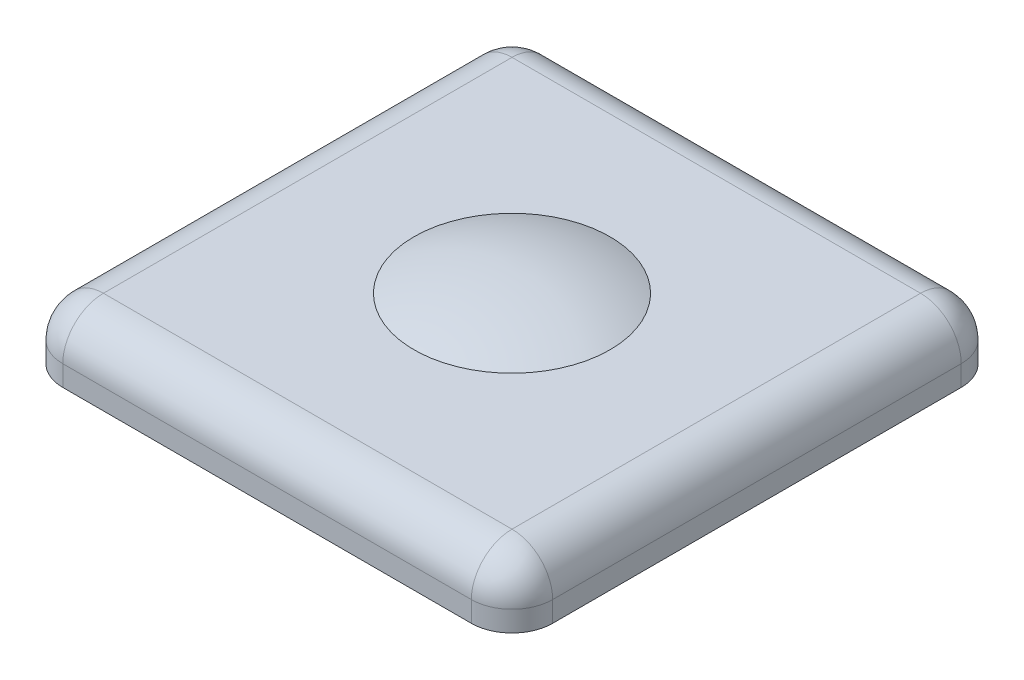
ISO-10303-21;
HEADER;
FILE_DESCRIPTION(('STEP AP214'),'2;1');
FILE_NAME('part.step','',(''),(''),'','','');
FILE_SCHEMA(('AUTOMOTIVE_DESIGN { 1 0 10303 214 1 1 1 1 }'));
ENDSEC;
DATA;
#1=APPLICATION_CONTEXT('core data for automotive mechanical design processes');
#2=APPLICATION_PROTOCOL_DEFINITION('international standard','automotive_design',2000,#1);
#3=PRODUCT_CONTEXT('',#1,'mechanical');
#4=PRODUCT('Part','Part','',(#3));
#5=PRODUCT_RELATED_PRODUCT_CATEGORY('part','',(#4));
#6=PRODUCT_DEFINITION_FORMATION('','',#4);
#7=PRODUCT_DEFINITION_CONTEXT('part definition',#1,'design');
#8=PRODUCT_DEFINITION('design','',#6,#7);
#9=PRODUCT_DEFINITION_SHAPE('','',#8);
#10=(LENGTH_UNIT() NAMED_UNIT(*) SI_UNIT(.MILLI.,.METRE.));
#11=(NAMED_UNIT(*) PLANE_ANGLE_UNIT() SI_UNIT($,.RADIAN.));
#12=(NAMED_UNIT(*) SI_UNIT($,.STERADIAN.) SOLID_ANGLE_UNIT());
#13=UNCERTAINTY_MEASURE_WITH_UNIT(LENGTH_MEASURE(1.E-05),#10,'distance_accuracy_value','');
#14=(GEOMETRIC_REPRESENTATION_CONTEXT(3) GLOBAL_UNCERTAINTY_ASSIGNED_CONTEXT((#13)) GLOBAL_UNIT_ASSIGNED_CONTEXT((#10,
#11,#12)) REPRESENTATION_CONTEXT('',''));
#15=CARTESIAN_POINT('',(0.,0.,0.));
#16=DIRECTION('',(0.,0.,1.));
#17=DIRECTION('',(1.,0.,0.));
#18=AXIS2_PLACEMENT_3D('',#15,#16,#17);
#19=CARTESIAN_POINT('',(0.,-7.0485,0.));
#20=DIRECTION('',(0.,-1.,0.));
#21=DIRECTION('',(1.,0.,0.));
#22=AXIS2_PLACEMENT_3D('',#19,#20,#21);
#23=CYLINDRICAL_SURFACE('',#22,1.65888275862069);
#24=DIRECTION('',(0.,-1.,0.));
#25=VECTOR('',#24,1.);
#26=CARTESIAN_POINT('',(0.650965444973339,-7.0485,1.52582305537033));
#27=LINE('',#26,#25);
#28=CARTESIAN_POINT('',(0.650965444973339,-6.3881,1.52582305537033));
#29=VERTEX_POINT('',#28);
#30=CARTESIAN_POINT('',(0.650965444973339,-6.0579,1.52582305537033));
#31=VERTEX_POINT('',#30);
#32=EDGE_CURVE('E339',#29,#31,#27,.F.);
#33=ORIENTED_EDGE('',*,*,#32,.F.);
#34=CARTESIAN_POINT('',(0.,-6.3881,0.));
#35=DIRECTION('',(0.,-1.,0.));
#36=DIRECTION('',(1.,0.,0.));
#37=AXIS2_PLACEMENT_3D('',#34,#35,#36);
#38=CIRCLE('',#37,1.65888275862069);
#39=CARTESIAN_POINT('',(-0.650965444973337,-6.3881,1.52582305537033));
#40=VERTEX_POINT('',#39);
#41=EDGE_CURVE('E185',#40,#29,#38,.T.);
#42=ORIENTED_EDGE('',*,*,#41,.F.);
#43=DIRECTION('',(0.,-1.,0.));
#44=VECTOR('',#43,1.);
#45=CARTESIAN_POINT('',(-0.650965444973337,-7.0485,1.52582305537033));
#46=LINE('',#45,#44);
#47=CARTESIAN_POINT('',(-0.650965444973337,-6.0579,1.52582305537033));
#48=VERTEX_POINT('',#47);
#49=EDGE_CURVE('E354',#48,#40,#46,.T.);
#50=ORIENTED_EDGE('',*,*,#49,.F.);
#51=CARTESIAN_POINT('',(0.,-6.0579,0.));
#52=DIRECTION('',(0.,-1.,0.));
#53=DIRECTION('',(1.,0.,0.));
#54=AXIS2_PLACEMENT_3D('',#51,#52,#53);
#55=CIRCLE('',#54,1.65888275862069);
#56=EDGE_CURVE('E473',#48,#31,#55,.T.);
#57=ORIENTED_EDGE('',*,*,#56,.T.);
#58=EDGE_LOOP('',(#33,#42,#50,#57));
#59=FACE_BOUND('',#58,.T.);
#60=ADVANCED_FACE('F46',(#59),#23,.T.);
#61=CARTESIAN_POINT('',(0.,-4.5085,0.));
#62=DIRECTION('',(0.,1.,0.));
#63=DIRECTION('',(-1.,0.,0.));
#64=AXIS2_PLACEMENT_3D('',#61,#62,#63);
#65=CONICAL_SURFACE('',#64,3.048,0.730906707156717);
#66=CARTESIAN_POINT('',(0.65091667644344,-6.0581,1.52564891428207));
#67=CARTESIAN_POINT('',(0.682351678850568,-5.92916702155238,1.63789600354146));
#68=CARTESIAN_POINT('',(0.713760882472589,-5.8001476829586,1.75005097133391));
#69=CARTESIAN_POINT('',(0.776543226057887,-5.54198850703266,1.97423213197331));
#70=CARTESIAN_POINT('',(0.807916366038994,-5.41284866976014,2.08625832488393));
#71=CARTESIAN_POINT('',(0.87064213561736,-5.15450063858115,2.31023747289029));
#72=CARTESIAN_POINT('',(0.901994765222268,-5.0252924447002,2.42219042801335));
#73=CARTESIAN_POINT('',(0.964685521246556,-4.76682757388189,2.64604455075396));
#74=CARTESIAN_POINT('',(0.996023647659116,-4.63757089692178,2.75794571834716));
#75=CARTESIAN_POINT('',(1.02735750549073,-4.5083,2.86983164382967));
#76=B_SPLINE_CURVE_WITH_KNOTS('',3,(#66,#67,#68,#69,#70,#71,#72,#73,#74,#75),.UNSPECIFIED.,.F.,
.F.,(4,2,2,2,4),(0.,0.5214415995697,1.04288294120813,1.5643240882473,2.08576548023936),.UNSPECIFIED.);
#77=CARTESIAN_POINT('',(1.02730902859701,-4.5085,2.86965854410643));
#78=VERTEX_POINT('',#77);
#79=EDGE_CURVE('E333',#31,#78,#76,.T.);
#80=ORIENTED_EDGE('',*,*,#79,.F.);
#81=ORIENTED_EDGE('',*,*,#56,.F.);
#82=CARTESIAN_POINT('',(-1.02735750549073,-4.5083,2.86983164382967));
#83=CARTESIAN_POINT('',(-0.996023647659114,-4.63757089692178,2.75794571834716));
#84=CARTESIAN_POINT('',(-0.964685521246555,-4.76682757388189,2.64604455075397));
#85=CARTESIAN_POINT('',(-0.901994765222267,-5.02529244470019,2.42219042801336));
#86=CARTESIAN_POINT('',(-0.870642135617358,-5.15450063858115,2.31023747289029));
#87=CARTESIAN_POINT('',(-0.807916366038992,-5.41284866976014,2.08625832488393));
#88=CARTESIAN_POINT('',(-0.776543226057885,-5.54198850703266,1.97423213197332));
#89=CARTESIAN_POINT('',(-0.713760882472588,-5.8001476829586,1.75005097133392));
#90=CARTESIAN_POINT('',(-0.682351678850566,-5.92916702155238,1.63789600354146));
#91=CARTESIAN_POINT('',(-0.650916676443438,-6.0581,1.52564891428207));
#92=B_SPLINE_CURVE_WITH_KNOTS('',3,(#82,#83,#84,#85,#86,#87,#88,#89,#90,#91),.UNSPECIFIED.,.F.,
.F.,(4,2,2,2,4),(0.,0.52144139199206,1.04288253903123,1.56432388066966,2.08576548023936),.UNSPECIFIED.);
#93=CARTESIAN_POINT('',(-1.02730902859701,-4.5085,2.86965854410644));
#94=VERTEX_POINT('',#93);
#95=EDGE_CURVE('E348',#94,#48,#92,.T.);
#96=ORIENTED_EDGE('',*,*,#95,.F.);
#97=CARTESIAN_POINT('',(0.,-4.5085,0.));
#98=DIRECTION('',(0.,-1.,0.));
#99=DIRECTION('',(1.,0.,0.));
#100=AXIS2_PLACEMENT_3D('',#97,#98,#99);
#101=CIRCLE('',#100,3.048);
#102=EDGE_CURVE('E470',#94,#78,#101,.T.);
#103=ORIENTED_EDGE('',*,*,#102,.T.);
#104=EDGE_LOOP('',(#80,#81,#96,#103));
#105=FACE_BOUND('',#104,.T.);
#106=ADVANCED_FACE('F341',(#105),#65,.T.);
#107=CARTESIAN_POINT('',(-1.60019999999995,-4.5085,0.));
#108=DIRECTION('',(0.,-1.,0.));
#109=DIRECTION('',(1.,0.,0.));
#110=AXIS2_PLACEMENT_3D('',#107,#108,#109);
#111=PLANE('',#110);
#112=DIRECTION('',(-0.269676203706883,0.,-0.962951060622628));
#113=VECTOR('',#112,1.);
#114=CARTESIAN_POINT('',(0.0910155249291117,-4.5085,-0.473627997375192));
#115=LINE('',#114,#113);
#116=CARTESIAN_POINT('',(0.635000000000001,-4.50849999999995,1.46881416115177));
#117=VERTEX_POINT('',#116);
#118=EDGE_CURVE('E194',#78,#117,#115,.T.);
#119=ORIENTED_EDGE('',*,*,#118,.F.);
#120=ORIENTED_EDGE('',*,*,#102,.F.);
#121=DIRECTION('',(-0.269676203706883,0.,0.962951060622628));
#122=VECTOR('',#121,1.);
#123=CARTESIAN_POINT('',(-0.323765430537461,-4.5085,0.357467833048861));
#124=LINE('',#123,#122);
#125=CARTESIAN_POINT('',(-0.634999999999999,-4.50849999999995,1.46881416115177));
#126=VERTEX_POINT('',#125);
#127=EDGE_CURVE('E307',#126,#94,#124,.T.);
#128=ORIENTED_EDGE('',*,*,#127,.F.);
#129=CARTESIAN_POINT('',(0.,-4.5085,0.));
#130=DIRECTION('',(0.,-1.,0.));
#131=DIRECTION('',(1.,0.,0.));
#132=AXIS2_PLACEMENT_3D('',#129,#130,#131);
#133=CIRCLE('',#132,1.60019999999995);
#134=EDGE_CURVE('E467',#126,#117,#133,.T.);
#135=ORIENTED_EDGE('',*,*,#134,.T.);
#136=EDGE_LOOP('',(#119,#120,#128,#135));
#137=FACE_BOUND('',#136,.T.);
#138=ADVANCED_FACE('F313',(#137),#111,.F.);
#139=CARTESIAN_POINT('',(0.,-2.97695907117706,0.));
#140=DIRECTION('',(0.,1.,0.));
#141=DIRECTION('',(-1.,0.,0.));
#142=AXIS2_PLACEMENT_3D('',#139,#140,#141);
#143=CONICAL_SURFACE('',#142,3.04799999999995,0.75729836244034);
#144=CARTESIAN_POINT('',(0.634948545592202,-4.5087,1.46863042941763));
#145=CARTESIAN_POINT('',(0.664372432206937,-4.39431604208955,1.5736962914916));
#146=CARTESIAN_POINT('',(0.693771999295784,-4.2798462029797,1.67867531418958));
#147=CARTESIAN_POINT('',(0.752537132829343,-4.05078666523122,1.88851195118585));
#148=CARTESIAN_POINT('',(0.781902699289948,-3.93619696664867,1.99336956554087));
#149=CARTESIAN_POINT('',(0.869970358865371,-3.59232592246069,2.30783871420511));
#150=CARTESIAN_POINT('',(0.928643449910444,-3.36294248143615,2.51734668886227));
#151=CARTESIAN_POINT('',(1.00065303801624,-3.08125243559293,2.77447619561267));
#152=CARTESIAN_POINT('',(1.01400694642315,-3.02900700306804,2.82215989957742));
#153=CARTESIAN_POINT('',(1.02736014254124,-2.97675907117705,2.86984106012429));
#154=B_SPLINE_CURVE_WITH_KNOTS('',3,(#144,#145,#146,#147,#148,#149,#150,#151,#152,#153),
.UNSPECIFIED.,.F.,.F.,(4,2,2,2,4),(0.,0.474230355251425,0.948460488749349,1.89692014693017,
2.11287113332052),.UNSPECIFIED.);
#155=CARTESIAN_POINT('',(1.027309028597,-2.97695907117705,2.86965854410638));
#156=VERTEX_POINT('',#155);
#157=EDGE_CURVE('E319',#117,#156,#154,.T.);
#158=ORIENTED_EDGE('',*,*,#157,.F.);
#159=ORIENTED_EDGE('',*,*,#134,.F.);
#160=CARTESIAN_POINT('',(-1.02736014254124,-2.97675907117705,2.86984106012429));
#161=CARTESIAN_POINT('',(-0.994698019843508,-3.10455757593,2.7532122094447));
#162=CARTESIAN_POINT('',(-0.962031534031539,-3.23234075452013,2.636567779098));
#163=CARTESIAN_POINT('',(-0.896683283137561,-3.48785323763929,2.40322435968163));
#164=CARTESIAN_POINT('',(-0.864001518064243,-3.61558254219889,2.28652537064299));
#165=CARTESIAN_POINT('',(-0.798616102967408,-3.87096426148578,2.05304924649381));
#166=CARTESIAN_POINT('',(-0.765912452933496,-3.9986166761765,1.93627211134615));
#167=CARTESIAN_POINT('',(-0.70046508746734,-4.25378032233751,1.7025747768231));
#168=CARTESIAN_POINT('',(-0.667721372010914,-4.38129155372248,1.58565457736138));
#169=CARTESIAN_POINT('',(-0.6349485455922,-4.5087,1.46863042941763));
#170=B_SPLINE_CURVE_WITH_KNOTS('',3,(#160,#161,#162,#163,#164,#165,#166,#167,#168,#169),
.UNSPECIFIED.,.F.,.F.,(4,2,2,2,4),(0.,0.528217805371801,1.05643531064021,1.58465306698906,
2.11287114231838),.UNSPECIFIED.);
#171=CARTESIAN_POINT('',(-1.027309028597,-2.97695907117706,2.86965854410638));
#172=VERTEX_POINT('',#171);
#173=EDGE_CURVE('E300',#172,#126,#170,.T.);
#174=ORIENTED_EDGE('',*,*,#173,.F.);
#175=CARTESIAN_POINT('',(0.,-2.97695907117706,0.));
#176=DIRECTION('',(0.,-1.,0.));
#177=DIRECTION('',(1.,0.,0.));
#178=AXIS2_PLACEMENT_3D('',#175,#176,#177);
#179=CIRCLE('',#178,3.04799999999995);
#180=EDGE_CURVE('E464',#172,#156,#179,.T.);
#181=ORIENTED_EDGE('',*,*,#180,.T.);
#182=EDGE_LOOP('',(#158,#159,#174,#181));
#183=FACE_BOUND('',#182,.T.);
#184=ADVANCED_FACE('F308',(#183),#143,.T.);
#185=CARTESIAN_POINT('',(0.,-3.53387742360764,0.));
#186=DIRECTION('',(0.,1.,0.));
#187=DIRECTION('',(-1.,0.,0.));
#188=AXIS2_PLACEMENT_3D('',#185,#186,#187);
#189=CONICAL_SURFACE('',#188,1.60019999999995,1.20357905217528);
#190=CARTESIAN_POINT('',(1.02744959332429,-2.97675907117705,2.87016046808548));
#191=CARTESIAN_POINT('',(0.994750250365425,-3.02328376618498,2.75339871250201));
#192=CARTESIAN_POINT('',(0.962049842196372,-3.06979817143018,2.63663315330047));
#193=CARTESIAN_POINT('',(0.896645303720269,-3.16279089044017,2.40308874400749));
#194=CARTESIAN_POINT('',(0.863941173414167,-3.20926920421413,2.28630989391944));
#195=CARTESIAN_POINT('',(0.798527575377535,-3.30217426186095,2.05273313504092));
#196=CARTESIAN_POINT('',(0.765818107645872,-3.34860100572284,1.93593522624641));
#197=CARTESIAN_POINT('',(0.700389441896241,-3.4413602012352,1.70230466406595));
#198=CARTESIAN_POINT('',(0.667670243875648,-3.48769265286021,1.58547201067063));
#199=CARTESIAN_POINT('',(0.634943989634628,-3.53395658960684,1.46861416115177));
#200=B_SPLINE_CURVE_WITH_KNOTS('',3,(#190,#191,#192,#193,#194,#195,#196,#197,#198,#199),
.UNSPECIFIED.,.F.,.F.,(4,2,2,2,4),(0.,0.389620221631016,0.779240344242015,1.16886054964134,
1.55848086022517),.UNSPECIFIED.);
#201=CARTESIAN_POINT('',(0.635000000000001,-3.53387742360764,1.46881416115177));
#202=VERTEX_POINT('',#201);
#203=EDGE_CURVE('E326',#156,#202,#200,.T.);
#204=ORIENTED_EDGE('',*,*,#203,.F.);
#205=ORIENTED_EDGE('',*,*,#180,.F.);
#206=CARTESIAN_POINT('',(-0.634943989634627,-3.53395658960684,1.46861416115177));
#207=CARTESIAN_POINT('',(-0.667670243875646,-3.48769265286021,1.58547201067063));
#208=CARTESIAN_POINT('',(-0.700389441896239,-3.4413602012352,1.70230466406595));
#209=CARTESIAN_POINT('',(-0.765818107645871,-3.34860100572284,1.93593522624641));
#210=CARTESIAN_POINT('',(-0.798527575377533,-3.30217426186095,2.05273313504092));
#211=CARTESIAN_POINT('',(-0.863941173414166,-3.20926920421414,2.28630989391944));
#212=CARTESIAN_POINT('',(-0.896645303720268,-3.16279089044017,2.40308874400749));
#213=CARTESIAN_POINT('',(-0.962049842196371,-3.06979817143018,2.63663315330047));
#214=CARTESIAN_POINT('',(-0.994750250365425,-3.02328376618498,2.75339871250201));
#215=CARTESIAN_POINT('',(-1.02744959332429,-2.97675907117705,2.87016046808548));
#216=B_SPLINE_CURVE_WITH_KNOTS('',3,(#206,#207,#208,#209,#210,#211,#212,#213,#214,#215),
.UNSPECIFIED.,.F.,.F.,(4,2,2,2,4),(0.,0.389620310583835,0.779240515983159,1.16886063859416,
1.55848086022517),.UNSPECIFIED.);
#217=CARTESIAN_POINT('',(-0.634999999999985,-3.53387742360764,1.46881416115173));
#218=VERTEX_POINT('',#217);
#219=EDGE_CURVE('E293',#218,#172,#216,.T.);
#220=ORIENTED_EDGE('',*,*,#219,.F.);
#221=CARTESIAN_POINT('',(0.,-3.53387742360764,0.));
#222=DIRECTION('',(0.,-1.,0.));
#223=DIRECTION('',(1.,0.,0.));
#224=AXIS2_PLACEMENT_3D('',#221,#222,#223);
#225=CIRCLE('',#224,1.60019999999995);
#226=EDGE_CURVE('E461',#218,#202,#225,.T.);
#227=ORIENTED_EDGE('',*,*,#226,.T.);
#228=EDGE_LOOP('',(#204,#205,#220,#227));
#229=FACE_BOUND('',#228,.T.);
#230=ADVANCED_FACE('F312',(#229),#189,.F.);
#231=CARTESIAN_POINT('',(0.,-1.4943364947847,0.));
#232=DIRECTION('',(0.,1.,0.));
#233=DIRECTION('',(-1.,0.,0.));
#234=AXIS2_PLACEMENT_3D('',#231,#232,#233);
#235=CONICAL_SURFACE('',#234,3.04799999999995,0.75729836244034);
#236=CARTESIAN_POINT('',(0.634948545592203,-3.02607742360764,1.46863042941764));
#237=CARTESIAN_POINT('',(0.664372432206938,-2.91169346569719,1.57369629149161));
#238=CARTESIAN_POINT('',(0.693771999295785,-2.79722362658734,1.67867531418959));
#239=CARTESIAN_POINT('',(0.752537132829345,-2.56816408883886,1.88851195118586));
#240=CARTESIAN_POINT('',(0.78190269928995,-2.4535743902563,1.99336956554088));
#241=CARTESIAN_POINT('',(0.869970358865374,-2.10970334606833,2.30783871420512));
#242=CARTESIAN_POINT('',(0.928643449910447,-1.88031990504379,2.51734668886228));
#243=CARTESIAN_POINT('',(1.00065303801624,-1.59862985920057,2.77447619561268));
#244=CARTESIAN_POINT('',(1.01400694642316,-1.54638442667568,2.82215989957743));
#245=CARTESIAN_POINT('',(1.02736014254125,-1.49413649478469,2.8698410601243));
#246=B_SPLINE_CURVE_WITH_KNOTS('',3,(#236,#237,#238,#239,#240,#241,#242,#243,#244,#245),
.UNSPECIFIED.,.F.,.F.,(4,2,2,2,4),(0.,0.474230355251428,0.948460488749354,1.89692014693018,
2.11287113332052),.UNSPECIFIED.);
#247=CARTESIAN_POINT('',(0.635000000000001,-3.0258774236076,1.46881416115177));
#248=VERTEX_POINT('',#247);
#249=CARTESIAN_POINT('',(1.027309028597,-1.4943364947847,2.86965854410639));
#250=VERTEX_POINT('',#249);
#251=EDGE_CURVE('E429',#248,#250,#246,.T.);
#252=ORIENTED_EDGE('',*,*,#251,.F.);
#253=CARTESIAN_POINT('',(0.,-3.02587742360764,0.));
#254=DIRECTION('',(0.,-1.,0.));
#255=DIRECTION('',(1.,0.,0.));
#256=AXIS2_PLACEMENT_3D('',#253,#254,#255);
#257=CIRCLE('',#256,1.60019999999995);
#258=CARTESIAN_POINT('',(-0.634999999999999,-3.0258774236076,1.46881416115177));
#259=VERTEX_POINT('',#258);
#260=EDGE_CURVE('E449',#259,#248,#257,.T.);
#261=ORIENTED_EDGE('',*,*,#260,.F.);
#262=CARTESIAN_POINT('',(-1.02736014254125,-1.4941364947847,2.8698410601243));
#263=CARTESIAN_POINT('',(-0.99469801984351,-1.62193499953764,2.7532122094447));
#264=CARTESIAN_POINT('',(-0.962031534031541,-1.74971817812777,2.636567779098));
#265=CARTESIAN_POINT('',(-0.896683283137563,-2.00523066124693,2.40322435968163));
#266=CARTESIAN_POINT('',(-0.864001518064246,-2.13295996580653,2.286525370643));
#267=CARTESIAN_POINT('',(-0.798616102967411,-2.38834168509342,2.05304924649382));
#268=CARTESIAN_POINT('',(-0.765912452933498,-2.51599409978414,1.93627211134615));
#269=CARTESIAN_POINT('',(-0.700465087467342,-2.77115774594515,1.70257477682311));
#270=CARTESIAN_POINT('',(-0.667721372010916,-2.89866897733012,1.58565457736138));
#271=CARTESIAN_POINT('',(-0.634948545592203,-3.02607742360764,1.46863042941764));
#272=B_SPLINE_CURVE_WITH_KNOTS('',3,(#262,#263,#264,#265,#266,#267,#268,#269,#270,#271),
.UNSPECIFIED.,.F.,.F.,(4,2,2,2,4),(0.,0.528217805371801,1.05643531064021,1.58465306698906,
2.11287114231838),.UNSPECIFIED.);
#273=CARTESIAN_POINT('',(-1.027309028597,-1.4943364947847,2.86965854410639));
#274=VERTEX_POINT('',#273);
#275=EDGE_CURVE('E286',#274,#259,#272,.T.);
#276=ORIENTED_EDGE('',*,*,#275,.F.);
#277=CARTESIAN_POINT('',(0.,-1.4943364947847,0.));
#278=DIRECTION('',(0.,-1.,0.));
#279=DIRECTION('',(1.,0.,0.));
#280=AXIS2_PLACEMENT_3D('',#277,#278,#279);
#281=CIRCLE('',#280,3.04799999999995);
#282=EDGE_CURVE('E451',#274,#250,#281,.T.);
#283=ORIENTED_EDGE('',*,*,#282,.T.);
#284=EDGE_LOOP('',(#252,#261,#276,#283));
#285=FACE_BOUND('',#284,.T.);
#286=ADVANCED_FACE('F422',(#285),#235,.T.);
#287=CARTESIAN_POINT('',(0.,-2.05125484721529,0.));
#288=DIRECTION('',(0.,1.,0.));
#289=DIRECTION('',(-1.,0.,0.));
#290=AXIS2_PLACEMENT_3D('',#287,#288,#289);
#291=CONICAL_SURFACE('',#290,1.60019999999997,1.20357905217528);
#292=CARTESIAN_POINT('',(1.02744959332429,-1.4941364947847,2.87016046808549));
#293=CARTESIAN_POINT('',(0.994750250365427,-1.54066118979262,2.75339871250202));
#294=CARTESIAN_POINT('',(0.962049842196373,-1.58717559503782,2.63663315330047));
#295=CARTESIAN_POINT('',(0.896645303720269,-1.68016831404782,2.40308874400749));
#296=CARTESIAN_POINT('',(0.863941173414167,-1.72664662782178,2.28630989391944));
#297=CARTESIAN_POINT('',(0.798527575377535,-1.8195516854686,2.05273313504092));
#298=CARTESIAN_POINT('',(0.765818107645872,-1.86597842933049,1.93593522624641));
#299=CARTESIAN_POINT('',(0.700389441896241,-1.95873762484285,1.70230466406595));
#300=CARTESIAN_POINT('',(0.667670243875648,-2.00507007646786,1.58547201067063));
#301=CARTESIAN_POINT('',(0.634943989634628,-2.05133401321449,1.46861416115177));
#302=B_SPLINE_CURVE_WITH_KNOTS('',3,(#292,#293,#294,#295,#296,#297,#298,#299,#300,#301),
.UNSPECIFIED.,.F.,.F.,(4,2,2,2,4),(0.,0.389620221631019,0.77924034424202,1.16886054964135,
1.55848086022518),.UNSPECIFIED.);
#303=CARTESIAN_POINT('',(0.635,-2.05125484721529,1.46881416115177));
#304=VERTEX_POINT('',#303);
#305=EDGE_CURVE('E409',#250,#304,#302,.T.);
#306=ORIENTED_EDGE('',*,*,#305,.F.);
#307=ORIENTED_EDGE('',*,*,#282,.F.);
#308=CARTESIAN_POINT('',(-0.634943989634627,-2.05133401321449,1.46861416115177));
#309=CARTESIAN_POINT('',(-0.667670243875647,-2.00507007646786,1.58547201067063));
#310=CARTESIAN_POINT('',(-0.70038944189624,-1.95873762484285,1.70230466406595));
#311=CARTESIAN_POINT('',(-0.765818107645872,-1.86597842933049,1.93593522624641));
#312=CARTESIAN_POINT('',(-0.798527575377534,-1.8195516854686,2.05273313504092));
#313=CARTESIAN_POINT('',(-0.863941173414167,-1.72664662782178,2.28630989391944));
#314=CARTESIAN_POINT('',(-0.896645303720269,-1.68016831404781,2.40308874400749));
#315=CARTESIAN_POINT('',(-0.962049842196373,-1.58717559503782,2.63663315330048));
#316=CARTESIAN_POINT('',(-0.994750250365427,-1.54066118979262,2.75339871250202));
#317=CARTESIAN_POINT('',(-1.02744959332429,-1.4941364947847,2.87016046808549));
#318=B_SPLINE_CURVE_WITH_KNOTS('',3,(#308,#309,#310,#311,#312,#313,#314,#315,#316,#317),
.UNSPECIFIED.,.F.,.F.,(4,2,2,2,4),(0.,0.389620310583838,0.779240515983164,1.16886063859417,
1.55848086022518),.UNSPECIFIED.);
#319=CARTESIAN_POINT('',(-0.634999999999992,-2.05125484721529,1.46881416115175));
#320=VERTEX_POINT('',#319);
#321=EDGE_CURVE('E278',#320,#274,#318,.T.);
#322=ORIENTED_EDGE('',*,*,#321,.F.);
#323=CARTESIAN_POINT('',(0.,-2.05125484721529,0.));
#324=DIRECTION('',(0.,-1.,0.));
#325=DIRECTION('',(1.,0.,0.));
#326=AXIS2_PLACEMENT_3D('',#323,#324,#325);
#327=CIRCLE('',#326,1.60019999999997);
#328=EDGE_CURVE('E447',#320,#304,#327,.T.);
#329=ORIENTED_EDGE('',*,*,#328,.T.);
#330=EDGE_LOOP('',(#306,#307,#322,#329));
#331=FACE_BOUND('',#330,.T.);
#332=ADVANCED_FACE('F417',(#331),#291,.F.);
#333=CARTESIAN_POINT('',(0.,-0.0117139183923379,0.));
#334=DIRECTION('',(0.,1.,0.));
#335=DIRECTION('',(-1.,0.,0.));
#336=AXIS2_PLACEMENT_3D('',#333,#334,#335);
#337=CONICAL_SURFACE('',#336,3.04799999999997,0.75729836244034);
#338=CARTESIAN_POINT('',(0.634948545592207,-1.54345484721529,1.46863042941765));
#339=CARTESIAN_POINT('',(0.664372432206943,-1.42907088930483,1.57369629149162));
#340=CARTESIAN_POINT('',(0.69377199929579,-1.31460105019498,1.67867531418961));
#341=CARTESIAN_POINT('',(0.75253713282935,-1.0855415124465,1.88851195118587));
#342=CARTESIAN_POINT('',(0.781902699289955,-0.970951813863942,1.9933695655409));
#343=CARTESIAN_POINT('',(0.86997035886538,-0.627080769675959,2.30783871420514));
#344=CARTESIAN_POINT('',(0.928643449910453,-0.397697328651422,2.5173466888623));
#345=CARTESIAN_POINT('',(1.00065303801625,-0.1160072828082,2.7744761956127));
#346=CARTESIAN_POINT('',(1.01400694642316,-0.0637618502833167,2.82215989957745));
#347=CARTESIAN_POINT('',(1.02736014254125,-0.0115139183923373,2.86984106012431));
#348=B_SPLINE_CURVE_WITH_KNOTS('',3,(#338,#339,#340,#341,#342,#343,#344,#345,#346,#347),
.UNSPECIFIED.,.F.,.F.,(4,2,2,2,4),(0.,0.474230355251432,0.948460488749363,1.8969201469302,
2.11287113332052),.UNSPECIFIED.);
#349=CARTESIAN_POINT('',(0.635,-1.54325484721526,1.46881416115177));
#350=VERTEX_POINT('',#349);
#351=CARTESIAN_POINT('',(1.027309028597,-0.0117139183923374,2.8696585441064));
#352=VERTEX_POINT('',#351);
#353=EDGE_CURVE('E403',#350,#352,#348,.T.);
#354=ORIENTED_EDGE('',*,*,#353,.F.);
#355=CARTESIAN_POINT('',(0.,-1.54325484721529,0.));
#356=DIRECTION('',(0.,-1.,0.));
#357=DIRECTION('',(1.,0.,0.));
#358=AXIS2_PLACEMENT_3D('',#355,#356,#357);
#359=CIRCLE('',#358,1.60019999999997);
#360=CARTESIAN_POINT('',(-0.635,-1.54325484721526,1.46881416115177));
#361=VERTEX_POINT('',#360);
#362=EDGE_CURVE('E452',#361,#350,#359,.T.);
#363=ORIENTED_EDGE('',*,*,#362,.F.);
#364=CARTESIAN_POINT('',(-1.02736014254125,-0.0115139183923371,2.86984106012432));
#365=CARTESIAN_POINT('',(-0.994698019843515,-0.139312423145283,2.75321220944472));
#366=CARTESIAN_POINT('',(-0.962031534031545,-0.267095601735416,2.63656777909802));
#367=CARTESIAN_POINT('',(-0.896683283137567,-0.522608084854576,2.40322435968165));
#368=CARTESIAN_POINT('',(-0.86400151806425,-0.650337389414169,2.28652537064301));
#369=CARTESIAN_POINT('',(-0.798616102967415,-0.905719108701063,2.05304924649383));
#370=CARTESIAN_POINT('',(-0.765912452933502,-1.03337152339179,1.93627211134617));
#371=CARTESIAN_POINT('',(-0.700465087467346,-1.28853516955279,1.70257477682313));
#372=CARTESIAN_POINT('',(-0.66772137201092,-1.41604640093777,1.5856545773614));
#373=CARTESIAN_POINT('',(-0.634948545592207,-1.54345484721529,1.46863042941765));
#374=B_SPLINE_CURVE_WITH_KNOTS('',3,(#364,#365,#366,#367,#368,#369,#370,#371,#372,#373),
.UNSPECIFIED.,.F.,.F.,(4,2,2,2,4),(0.,0.528217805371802,1.05643531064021,1.58465306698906,
2.11287114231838),.UNSPECIFIED.);
#375=CARTESIAN_POINT('',(-1.027309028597,-0.0117139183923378,2.8696585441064));
#376=VERTEX_POINT('',#375);
#377=EDGE_CURVE('E270',#376,#361,#374,.T.);
#378=ORIENTED_EDGE('',*,*,#377,.F.);
#379=CARTESIAN_POINT('',(0.,-0.0117139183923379,0.));
#380=DIRECTION('',(0.,-1.,0.));
#381=DIRECTION('',(1.,0.,0.));
#382=AXIS2_PLACEMENT_3D('',#379,#380,#381);
#383=CIRCLE('',#382,3.04799999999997);
#384=EDGE_CURVE('E456',#376,#352,#383,.T.);
#385=ORIENTED_EDGE('',*,*,#384,.T.);
#386=EDGE_LOOP('',(#354,#363,#378,#385));
#387=FACE_BOUND('',#386,.T.);
#388=ADVANCED_FACE('F414',(#387),#337,.T.);
#389=CARTESIAN_POINT('',(0.,-0.568632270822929,0.));
#390=DIRECTION('',(0.,1.,0.));
#391=DIRECTION('',(-1.,0.,0.));
#392=AXIS2_PLACEMENT_3D('',#389,#390,#391);
#393=CONICAL_SURFACE('',#392,1.60019999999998,1.20357905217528);
#394=CARTESIAN_POINT('',(1.02744959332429,-0.0115139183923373,2.8701604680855));
#395=CARTESIAN_POINT('',(0.99475025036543,-0.0580386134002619,2.75339871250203));
#396=CARTESIAN_POINT('',(0.962049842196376,-0.104553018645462,2.63663315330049));
#397=CARTESIAN_POINT('',(0.896645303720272,-0.197545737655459,2.4030887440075));
#398=CARTESIAN_POINT('',(0.86394117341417,-0.244024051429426,2.28630989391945));
#399=CARTESIAN_POINT('',(0.798527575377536,-0.336929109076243,2.05273313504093));
#400=CARTESIAN_POINT('',(0.765818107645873,-0.383355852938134,1.93593522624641));
#401=CARTESIAN_POINT('',(0.700389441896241,-0.476115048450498,1.70230466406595));
#402=CARTESIAN_POINT('',(0.667670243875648,-0.522447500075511,1.58547201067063));
#403=CARTESIAN_POINT('',(0.634943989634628,-0.568711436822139,1.46861416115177));
#404=B_SPLINE_CURVE_WITH_KNOTS('',3,(#394,#395,#396,#397,#398,#399,#400,#401,#402,#403),
.UNSPECIFIED.,.F.,.F.,(4,2,2,2,4),(0.,0.389620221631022,0.779240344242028,1.16886054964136,
1.5584808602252),.UNSPECIFIED.);
#405=CARTESIAN_POINT('',(0.635,-0.568632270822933,1.46881416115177));
#406=VERTEX_POINT('',#405);
#407=EDGE_CURVE('E397',#352,#406,#404,.T.);
#408=ORIENTED_EDGE('',*,*,#407,.F.);
#409=ORIENTED_EDGE('',*,*,#384,.F.);
#410=CARTESIAN_POINT('',(-0.634943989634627,-0.56871143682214,1.46861416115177));
#411=CARTESIAN_POINT('',(-0.667670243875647,-0.522447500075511,1.58547201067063));
#412=CARTESIAN_POINT('',(-0.700389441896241,-0.476115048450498,1.70230466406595));
#413=CARTESIAN_POINT('',(-0.765818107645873,-0.383355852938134,1.93593522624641));
#414=CARTESIAN_POINT('',(-0.798527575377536,-0.336929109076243,2.05273313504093));
#415=CARTESIAN_POINT('',(-0.86394117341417,-0.244024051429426,2.28630989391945));
#416=CARTESIAN_POINT('',(-0.896645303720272,-0.197545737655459,2.4030887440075));
#417=CARTESIAN_POINT('',(-0.962049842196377,-0.104553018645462,2.63663315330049));
#418=CARTESIAN_POINT('',(-0.994750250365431,-0.0580386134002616,2.75339871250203));
#419=CARTESIAN_POINT('',(-1.0274495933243,-0.0115139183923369,2.8701604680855));
#420=B_SPLINE_CURVE_WITH_KNOTS('',3,(#410,#411,#412,#413,#414,#415,#416,#417,#418,#419),
.UNSPECIFIED.,.F.,.F.,(4,2,2,2,4),(0.,0.389620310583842,0.779240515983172,1.16886063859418,
1.5584808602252),.UNSPECIFIED.);
#421=CARTESIAN_POINT('',(-0.634999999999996,-0.568632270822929,1.46881416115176));
#422=VERTEX_POINT('',#421);
#423=EDGE_CURVE('E262',#422,#376,#420,.T.);
#424=ORIENTED_EDGE('',*,*,#423,.F.);
#425=CARTESIAN_POINT('',(0.,-0.568632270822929,0.));
#426=DIRECTION('',(0.,-1.,0.));
#427=DIRECTION('',(1.,0.,0.));
#428=AXIS2_PLACEMENT_3D('',#425,#426,#427);
#429=CIRCLE('',#428,1.60019999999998);
#430=EDGE_CURVE('E520',#422,#406,#429,.T.);
#431=ORIENTED_EDGE('',*,*,#430,.T.);
#432=EDGE_LOOP('',(#408,#409,#424,#431));
#433=FACE_BOUND('',#432,.T.);
#434=ADVANCED_FACE('F387',(#433),#393,.F.);
#435=CARTESIAN_POINT('',(0.,1.47090865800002,0.));
#436=DIRECTION('',(0.,1.,0.));
#437=DIRECTION('',(-1.,0.,0.));
#438=AXIS2_PLACEMENT_3D('',#435,#436,#437);
#439=CONICAL_SURFACE('',#438,3.04799999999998,0.757298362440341);
#440=CARTESIAN_POINT('',(0.634948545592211,-0.0608322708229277,1.46863042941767));
#441=CARTESIAN_POINT('',(0.664372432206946,0.0535516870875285,1.57369629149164));
#442=CARTESIAN_POINT('',(0.693771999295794,0.168021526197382,1.67867531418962));
#443=CARTESIAN_POINT('',(0.752537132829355,0.397081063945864,1.88851195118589));
#444=CARTESIAN_POINT('',(0.781902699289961,0.51167076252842,1.99336956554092));
#445=CARTESIAN_POINT('',(0.869970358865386,0.855541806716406,2.30783871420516));
#446=CARTESIAN_POINT('',(0.92864344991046,1.08492524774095,2.51734668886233));
#447=CARTESIAN_POINT('',(1.00065303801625,1.36661529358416,2.77447619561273));
#448=CARTESIAN_POINT('',(1.01400694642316,1.41886072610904,2.82215989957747));
#449=CARTESIAN_POINT('',(1.02736014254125,1.47110865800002,2.86984106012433));
#450=B_SPLINE_CURVE_WITH_KNOTS('',3,(#440,#441,#442,#443,#444,#445,#446,#447,#448,#449),
.UNSPECIFIED.,.F.,.F.,(4,2,2,2,4),(0.,0.474230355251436,0.948460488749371,1.89692014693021,
2.11287113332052),.UNSPECIFIED.);
#451=CARTESIAN_POINT('',(0.635,-0.0606322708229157,1.46881416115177));
#452=VERTEX_POINT('',#451);
#453=CARTESIAN_POINT('',(1.02730902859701,1.47090865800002,2.86965854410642));
#454=VERTEX_POINT('',#453);
#455=EDGE_CURVE('E391',#452,#454,#450,.T.);
#456=ORIENTED_EDGE('',*,*,#455,.F.);
#457=CARTESIAN_POINT('',(0.,-0.060632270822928,0.));
#458=DIRECTION('',(0.,-1.,0.));
#459=DIRECTION('',(1.,0.,0.));
#460=AXIS2_PLACEMENT_3D('',#457,#458,#459);
#461=CIRCLE('',#460,1.60019999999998);
#462=CARTESIAN_POINT('',(-0.635,-0.0606322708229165,1.46881416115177));
#463=VERTEX_POINT('',#462);
#464=EDGE_CURVE('E517',#463,#452,#461,.T.);
#465=ORIENTED_EDGE('',*,*,#464,.F.);
#466=CARTESIAN_POINT('',(-1.02736014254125,1.47110865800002,2.86984106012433));
#467=CARTESIAN_POINT('',(-0.994698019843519,1.34331015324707,2.75321220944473));
#468=CARTESIAN_POINT('',(-0.96203153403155,1.21552697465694,2.63656777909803));
#469=CARTESIAN_POINT('',(-0.896683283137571,0.960014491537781,2.40322435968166));
#470=CARTESIAN_POINT('',(-0.864001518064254,0.832285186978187,2.28652537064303));
#471=CARTESIAN_POINT('',(-0.798616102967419,0.576903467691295,2.05304924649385));
#472=CARTESIAN_POINT('',(-0.765912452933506,0.449251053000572,1.93627211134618));
#473=CARTESIAN_POINT('',(-0.70046508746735,0.194087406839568,1.70257477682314));
#474=CARTESIAN_POINT('',(-0.667721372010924,0.0665761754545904,1.58565457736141));
#475=CARTESIAN_POINT('',(-0.634948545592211,-0.0608322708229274,1.46863042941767));
#476=B_SPLINE_CURVE_WITH_KNOTS('',3,(#466,#467,#468,#469,#470,#471,#472,#473,#474,#475),
.UNSPECIFIED.,.F.,.F.,(4,2,2,2,4),(0.,0.528217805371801,1.05643531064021,1.58465306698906,
2.11287114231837),.UNSPECIFIED.);
#477=CARTESIAN_POINT('',(-1.02730902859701,1.47090865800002,2.86965854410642));
#478=VERTEX_POINT('',#477);
#479=EDGE_CURVE('E254',#478,#463,#476,.T.);
#480=ORIENTED_EDGE('',*,*,#479,.F.);
#481=CARTESIAN_POINT('',(0.,1.47090865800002,0.));
#482=DIRECTION('',(0.,-1.,0.));
#483=DIRECTION('',(1.,0.,0.));
#484=AXIS2_PLACEMENT_3D('',#481,#482,#483);
#485=CIRCLE('',#484,3.04799999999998);
#486=EDGE_CURVE('E514',#478,#454,#485,.T.);
#487=ORIENTED_EDGE('',*,*,#486,.T.);
#488=EDGE_LOOP('',(#456,#465,#480,#487));
#489=FACE_BOUND('',#488,.T.);
#490=ADVANCED_FACE('F382',(#489),#439,.T.);
#491=CARTESIAN_POINT('',(0.,0.913990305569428,0.));
#492=DIRECTION('',(0.,1.,0.));
#493=DIRECTION('',(-1.,0.,0.));
#494=AXIS2_PLACEMENT_3D('',#491,#492,#493);
#495=CONICAL_SURFACE('',#494,1.6002,1.20357905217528);
#496=CARTESIAN_POINT('',(1.0274495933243,1.47110865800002,2.87016046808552));
#497=CARTESIAN_POINT('',(0.994750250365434,1.42458396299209,2.75339871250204));
#498=CARTESIAN_POINT('',(0.96204984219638,1.37806955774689,2.6366331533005));
#499=CARTESIAN_POINT('',(0.896645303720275,1.2850768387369,2.40308874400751));
#500=CARTESIAN_POINT('',(0.863941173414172,1.23859852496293,2.28630989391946));
#501=CARTESIAN_POINT('',(0.798527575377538,1.14569346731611,2.05273313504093));
#502=CARTESIAN_POINT('',(0.765818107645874,1.09926672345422,1.93593522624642));
#503=CARTESIAN_POINT('',(0.700389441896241,1.00650752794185,1.70230466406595));
#504=CARTESIAN_POINT('',(0.667670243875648,0.960175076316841,1.58547201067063));
#505=CARTESIAN_POINT('',(0.634943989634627,0.913911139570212,1.46861416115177));
#506=B_SPLINE_CURVE_WITH_KNOTS('',3,(#496,#497,#498,#499,#500,#501,#502,#503,#504,#505),
.UNSPECIFIED.,.F.,.F.,(4,2,2,2,4),(0.,0.389620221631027,0.779240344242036,1.16886054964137,
1.55848086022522),.UNSPECIFIED.);
#507=CARTESIAN_POINT('',(0.635,0.913990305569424,1.46881416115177));
#508=VERTEX_POINT('',#507);
#509=EDGE_CURVE('E368',#454,#508,#506,.T.);
#510=ORIENTED_EDGE('',*,*,#509,.F.);
#511=ORIENTED_EDGE('',*,*,#486,.F.);
#512=CARTESIAN_POINT('',(-0.634943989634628,0.913911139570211,1.46861416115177));
#513=CARTESIAN_POINT('',(-0.667670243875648,0.96017507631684,1.58547201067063));
#514=CARTESIAN_POINT('',(-0.700389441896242,1.00650752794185,1.70230466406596));
#515=CARTESIAN_POINT('',(-0.765818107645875,1.09926672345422,1.93593522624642));
#516=CARTESIAN_POINT('',(-0.798527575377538,1.14569346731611,2.05273313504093));
#517=CARTESIAN_POINT('',(-0.863941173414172,1.23859852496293,2.28630989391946));
#518=CARTESIAN_POINT('',(-0.896645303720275,1.28507683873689,2.40308874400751));
#519=CARTESIAN_POINT('',(-0.96204984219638,1.37806955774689,2.6366331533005));
#520=CARTESIAN_POINT('',(-0.994750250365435,1.42458396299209,2.75339871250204));
#521=CARTESIAN_POINT('',(-1.0274495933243,1.47110865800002,2.87016046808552));
#522=B_SPLINE_CURVE_WITH_KNOTS('',3,(#512,#513,#514,#515,#516,#517,#518,#519,#520,#521),
.UNSPECIFIED.,.F.,.F.,(4,2,2,2,4),(0.,0.389620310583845,0.77924051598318,1.16886063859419,
1.55848086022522),.UNSPECIFIED.);
#523=CARTESIAN_POINT('',(-0.635000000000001,0.913990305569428,1.46881416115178));
#524=VERTEX_POINT('',#523);
#525=EDGE_CURVE('E246',#524,#478,#522,.T.);
#526=ORIENTED_EDGE('',*,*,#525,.F.);
#527=CARTESIAN_POINT('',(0.,0.913990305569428,0.));
#528=DIRECTION('',(0.,-1.,0.));
#529=DIRECTION('',(1.,0.,0.));
#530=AXIS2_PLACEMENT_3D('',#527,#528,#529);
#531=CIRCLE('',#530,1.6002);
#532=EDGE_CURVE('E511',#524,#508,#531,.T.);
#533=ORIENTED_EDGE('',*,*,#532,.T.);
#534=EDGE_LOOP('',(#510,#511,#526,#533));
#535=FACE_BOUND('',#534,.T.);
#536=ADVANCED_FACE('F377',(#535),#495,.F.);
#537=CARTESIAN_POINT('',(0.,2.95353123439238,0.));
#538=DIRECTION('',(0.,1.,0.));
#539=DIRECTION('',(-1.,0.,0.));
#540=AXIS2_PLACEMENT_3D('',#537,#538,#539);
#541=CONICAL_SURFACE('',#540,3.048,0.75729836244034);
#542=CARTESIAN_POINT('',(0.634948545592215,1.42179030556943,1.46863042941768));
#543=CARTESIAN_POINT('',(0.664372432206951,1.53617426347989,1.57369629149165));
#544=CARTESIAN_POINT('',(0.693771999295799,1.65064410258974,1.67867531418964));
#545=CARTESIAN_POINT('',(0.75253713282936,1.87970364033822,1.88851195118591));
#546=CARTESIAN_POINT('',(0.781902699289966,1.99429333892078,1.99336956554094));
#547=CARTESIAN_POINT('',(0.869970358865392,2.33816438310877,2.30783871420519));
#548=CARTESIAN_POINT('',(0.928643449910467,2.56754782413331,2.51734668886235));
#549=CARTESIAN_POINT('',(1.00065303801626,2.84923786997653,2.77447619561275));
#550=CARTESIAN_POINT('',(1.01400694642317,2.9014833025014,2.82215989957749));
#551=CARTESIAN_POINT('',(1.02736014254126,2.95373123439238,2.86984106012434));
#552=B_SPLINE_CURVE_WITH_KNOTS('',3,(#542,#543,#544,#545,#546,#547,#548,#549,#550,#551),
.UNSPECIFIED.,.F.,.F.,(4,2,2,2,4),(0.,0.474230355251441,0.94846048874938,1.89692014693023,
2.11287113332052),.UNSPECIFIED.);
#553=CARTESIAN_POINT('',(0.635,1.42199030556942,1.46881416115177));
#554=VERTEX_POINT('',#553);
#555=CARTESIAN_POINT('',(1.02730902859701,2.95353123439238,2.86965854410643));
#556=VERTEX_POINT('',#555);
#557=EDGE_CURVE('E362',#554,#556,#552,.T.);
#558=ORIENTED_EDGE('',*,*,#557,.F.);
#559=CARTESIAN_POINT('',(0.,1.42199030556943,0.));
#560=DIRECTION('',(0.,-1.,0.));
#561=DIRECTION('',(1.,0.,0.));
#562=AXIS2_PLACEMENT_3D('',#559,#560,#561);
#563=CIRCLE('',#562,1.6002);
#564=CARTESIAN_POINT('',(-0.635,1.42199030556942,1.46881416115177));
#565=VERTEX_POINT('',#564);
#566=EDGE_CURVE('E508',#565,#554,#563,.T.);
#567=ORIENTED_EDGE('',*,*,#566,.F.);
#568=CARTESIAN_POINT('',(-1.02736014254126,2.95373123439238,2.86984106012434));
#569=CARTESIAN_POINT('',(-0.994698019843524,2.82593272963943,2.75321220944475));
#570=CARTESIAN_POINT('',(-0.962031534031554,2.6981495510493,2.63656777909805));
#571=CARTESIAN_POINT('',(-0.896683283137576,2.44263706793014,2.40322435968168));
#572=CARTESIAN_POINT('',(-0.864001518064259,2.31490776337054,2.28652537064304));
#573=CARTESIAN_POINT('',(-0.798616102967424,2.05952604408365,2.05304924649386));
#574=CARTESIAN_POINT('',(-0.765912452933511,1.93187362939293,1.9362721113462));
#575=CARTESIAN_POINT('',(-0.700465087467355,1.67670998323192,1.70257477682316));
#576=CARTESIAN_POINT('',(-0.667721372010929,1.54919875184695,1.58565457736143));
#577=CARTESIAN_POINT('',(-0.634948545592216,1.42179030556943,1.46863042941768));
#578=B_SPLINE_CURVE_WITH_KNOTS('',3,(#568,#569,#570,#571,#572,#573,#574,#575,#576,#577),
.UNSPECIFIED.,.F.,.F.,(4,2,2,2,4),(0.,0.528217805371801,1.05643531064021,1.58465306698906,
2.11287114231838),.UNSPECIFIED.);
#579=CARTESIAN_POINT('',(-1.02730902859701,2.95353123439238,2.86965854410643));
#580=VERTEX_POINT('',#579);
#581=EDGE_CURVE('E220',#580,#565,#578,.T.);
#582=ORIENTED_EDGE('',*,*,#581,.F.);
#583=CARTESIAN_POINT('',(0.,2.95353123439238,0.));
#584=DIRECTION('',(0.,-1.,0.));
#585=DIRECTION('',(1.,0.,0.));
#586=AXIS2_PLACEMENT_3D('',#583,#584,#585);
#587=CIRCLE('',#586,3.048);
#588=EDGE_CURVE('E505',#580,#556,#587,.T.);
#589=ORIENTED_EDGE('',*,*,#588,.T.);
#590=EDGE_LOOP('',(#558,#567,#582,#589));
#591=FACE_BOUND('',#590,.T.);
#592=ADVANCED_FACE('F374',(#591),#541,.T.);
#593=CARTESIAN_POINT('',(0.,2.39661288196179,0.));
#594=DIRECTION('',(0.,1.,0.));
#595=DIRECTION('',(-1.,0.,0.));
#596=AXIS2_PLACEMENT_3D('',#593,#594,#595);
#597=CONICAL_SURFACE('',#596,1.6002,1.20357905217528);
#598=CARTESIAN_POINT('',(1.0274495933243,2.95373123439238,2.87016046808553));
#599=CARTESIAN_POINT('',(0.994750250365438,2.90720653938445,2.75339871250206));
#600=CARTESIAN_POINT('',(0.962049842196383,2.86069213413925,2.63663315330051));
#601=CARTESIAN_POINT('',(0.896645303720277,2.76769941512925,2.40308874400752));
#602=CARTESIAN_POINT('',(0.863941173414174,2.72122110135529,2.28630989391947));
#603=CARTESIAN_POINT('',(0.798527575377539,2.62831604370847,2.05273313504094));
#604=CARTESIAN_POINT('',(0.765818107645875,2.58188929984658,1.93593522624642));
#605=CARTESIAN_POINT('',(0.700389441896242,2.48913010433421,1.70230466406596));
#606=CARTESIAN_POINT('',(0.667670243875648,2.4427976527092,1.58547201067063));
#607=CARTESIAN_POINT('',(0.634943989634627,2.39653371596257,1.46861416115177));
#608=B_SPLINE_CURVE_WITH_KNOTS('',3,(#598,#599,#600,#601,#602,#603,#604,#605,#606,#607),
.UNSPECIFIED.,.F.,.F.,(4,2,2,2,4),(0.,0.389620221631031,0.779240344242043,1.16886054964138,
1.55848086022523),.UNSPECIFIED.);
#609=CARTESIAN_POINT('',(0.635,2.39661288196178,1.46881416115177));
#610=VERTEX_POINT('',#609);
#611=EDGE_CURVE('E356',#556,#610,#608,.T.);
#612=ORIENTED_EDGE('',*,*,#611,.F.);
#613=ORIENTED_EDGE('',*,*,#588,.F.);
#614=CARTESIAN_POINT('',(-0.634943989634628,2.39653371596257,1.46861416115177));
#615=CARTESIAN_POINT('',(-0.667670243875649,2.4427976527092,1.58547201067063));
#616=CARTESIAN_POINT('',(-0.700389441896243,2.48913010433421,1.70230466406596));
#617=CARTESIAN_POINT('',(-0.765818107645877,2.58188929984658,1.93593522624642));
#618=CARTESIAN_POINT('',(-0.798527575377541,2.62831604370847,2.05273313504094));
#619=CARTESIAN_POINT('',(-0.863941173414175,2.72122110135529,2.28630989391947));
#620=CARTESIAN_POINT('',(-0.896645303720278,2.76769941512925,2.40308874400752));
#621=CARTESIAN_POINT('',(-0.962049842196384,2.86069213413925,2.63663315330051));
#622=CARTESIAN_POINT('',(-0.994750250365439,2.90720653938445,2.75339871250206));
#623=CARTESIAN_POINT('',(-1.0274495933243,2.95373123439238,2.87016046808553));
#624=B_SPLINE_CURVE_WITH_KNOTS('',3,(#614,#615,#616,#617,#618,#619,#620,#621,#622,#623),
.UNSPECIFIED.,.F.,.F.,(4,2,2,2,4),(0.,0.389620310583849,0.779240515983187,1.1688606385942,
1.55848086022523),.UNSPECIFIED.);
#625=CARTESIAN_POINT('',(-0.635000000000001,2.39661288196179,1.46881416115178));
#626=VERTEX_POINT('',#625);
#627=EDGE_CURVE('E188',#626,#580,#624,.T.);
#628=ORIENTED_EDGE('',*,*,#627,.F.);
#629=CARTESIAN_POINT('',(0.,2.39661288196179,0.));
#630=DIRECTION('',(0.,-1.,0.));
#631=DIRECTION('',(1.,0.,0.));
#632=AXIS2_PLACEMENT_3D('',#629,#630,#631);
#633=CIRCLE('',#632,1.6002);
#634=EDGE_CURVE('E500',#626,#610,#633,.T.);
#635=ORIENTED_EDGE('',*,*,#634,.T.);
#636=EDGE_LOOP('',(#612,#613,#628,#635));
#637=FACE_BOUND('',#636,.T.);
#638=ADVANCED_FACE('F227',(#637),#597,.F.);
#639=CARTESIAN_POINT('',(-1.1938,-7.0485,0.));
#640=DIRECTION('',(0.,1.,0.));
#641=DIRECTION('',(-1.,0.,0.));
#642=AXIS2_PLACEMENT_3D('',#639,#640,#641);
#643=PLANE('',#642);
#644=CARTESIAN_POINT('',(0.,-7.0485,0.));
#645=DIRECTION('',(0.,-1.,0.));
#646=DIRECTION('',(1.,0.,0.));
#647=AXIS2_PLACEMENT_3D('',#644,#645,#646);
#648=CIRCLE('',#647,1.1938);
#649=CARTESIAN_POINT('',(1.1938,-7.0485,0.));
#650=VERTEX_POINT('',#649);
#651=EDGE_CURVE('E12',#650,#650,#648,.T.);
#652=ORIENTED_EDGE('',*,*,#651,.T.);
#653=EDGE_LOOP('',(#652));
#654=FACE_BOUND('',#653,.T.);
#655=ADVANCED_FACE('F48',(#654),#643,.F.);
#656=CARTESIAN_POINT('',(0.,-6.3881,0.));
#657=DIRECTION('',(0.,1.,0.));
#658=DIRECTION('',(-1.,0.,0.));
#659=AXIS2_PLACEMENT_3D('',#656,#657,#658);
#660=CONICAL_SURFACE('',#659,1.78588275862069,0.730906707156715);
#661=ORIENTED_EDGE('',*,*,#651,.F.);
#662=EDGE_LOOP('',(#661));
#663=FACE_BOUND('',#662,.T.);
#664=CARTESIAN_POINT('',(0.,-6.3881,0.));
#665=DIRECTION('',(0.,-1.,0.));
#666=DIRECTION('',(1.,0.,0.));
#667=AXIS2_PLACEMENT_3D('',#664,#665,#666);
#668=CIRCLE('',#667,1.78588275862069);
#669=CARTESIAN_POINT('',(1.78588275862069,-6.3881,0.));
#670=VERTEX_POINT('',#669);
#671=EDGE_CURVE('E54',#670,#670,#668,.T.);
#672=ORIENTED_EDGE('',*,*,#671,.T.);
#673=EDGE_LOOP('',(#672));
#674=FACE_BOUND('',#673,.T.);
#675=ADVANCED_FACE('F479',(#663,#674),#660,.T.);
#676=CARTESIAN_POINT('',(-1.65888275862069,-6.3881,0.));
#677=DIRECTION('',(0.,-1.,0.));
#678=DIRECTION('',(1.,0.,0.));
#679=AXIS2_PLACEMENT_3D('',#676,#677,#678);
#680=PLANE('',#679);
#681=ORIENTED_EDGE('',*,*,#41,.T.);
#682=DIRECTION('',(0.269676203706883,0.,0.962951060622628));
#683=VECTOR('',#682,1.);
#684=CARTESIAN_POINT('',(1.64631919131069,-6.3881,5.08));
#685=LINE('',#684,#683);
#686=CARTESIAN_POINT('',(0.635000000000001,-6.3881,1.46881416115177));
#687=VERTEX_POINT('',#686);
#688=EDGE_CURVE('E177',#687,#29,#685,.T.);
#689=ORIENTED_EDGE('',*,*,#688,.F.);
#690=CARTESIAN_POINT('',(0.,-6.3881,0.));
#691=DIRECTION('',(0.,-1.,0.));
#692=DIRECTION('',(1.,0.,0.));
#693=AXIS2_PLACEMENT_3D('',#690,#691,#692);
#694=CIRCLE('',#693,1.6002);
#695=CARTESIAN_POINT('',(-0.634999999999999,-6.3881,1.46881416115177));
#696=VERTEX_POINT('',#695);
#697=EDGE_CURVE('E183',#696,#687,#694,.F.);
#698=ORIENTED_EDGE('',*,*,#697,.F.);
#699=DIRECTION('',(0.269676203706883,0.,-0.962951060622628));
#700=VECTOR('',#699,1.);
#701=CARTESIAN_POINT('',(-1.64631919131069,-6.3881,5.08));
#702=LINE('',#701,#700);
#703=EDGE_CURVE('E199',#40,#696,#702,.T.);
#704=ORIENTED_EDGE('',*,*,#703,.F.);
#705=EDGE_LOOP('',(#681,#689,#698,#704));
#706=FACE_BOUND('',#705,.T.);
#707=ORIENTED_EDGE('',*,*,#671,.F.);
#708=EDGE_LOOP('',(#707));
#709=FACE_BOUND('',#708,.T.);
#710=ADVANCED_FACE('F179',(#706,#709),#680,.F.);
#711=CARTESIAN_POINT('',(0.,-7.0485,0.));
#712=DIRECTION('',(0.,-1.,0.));
#713=DIRECTION('',(1.,0.,0.));
#714=AXIS2_PLACEMENT_3D('',#711,#712,#713);
#715=CYLINDRICAL_SURFACE('',#714,1.6002);
#716=ORIENTED_EDGE('',*,*,#260,.T.);
#717=DIRECTION('',(0.,1.,0.));
#718=VECTOR('',#717,1.);
#719=CARTESIAN_POINT('',(0.635000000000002,-11.2750346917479,1.46881416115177));
#720=LINE('',#719,#718);
#721=EDGE_CURVE('E439',#248,#304,#720,.T.);
#722=ORIENTED_EDGE('',*,*,#721,.T.);
#723=ORIENTED_EDGE('',*,*,#328,.F.);
#724=DIRECTION('',(0.,1.,0.));
#725=VECTOR('',#724,1.);
#726=CARTESIAN_POINT('',(-0.634999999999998,-11.2750346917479,1.46881416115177));
#727=LINE('',#726,#725);
#728=EDGE_CURVE('E69',#259,#320,#727,.T.);
#729=ORIENTED_EDGE('',*,*,#728,.F.);
#730=EDGE_LOOP('',(#716,#722,#723,#729));
#731=FACE_BOUND('',#730,.T.);
#732=ORIENTED_EDGE('',*,*,#362,.T.);
#733=EDGE_CURVE('E450',#350,#406,#720,.T.);
#734=ORIENTED_EDGE('',*,*,#733,.T.);
#735=ORIENTED_EDGE('',*,*,#430,.F.);
#736=EDGE_CURVE('E755',#361,#422,#727,.T.);
#737=ORIENTED_EDGE('',*,*,#736,.F.);
#738=EDGE_LOOP('',(#732,#734,#735,#737));
#739=FACE_BOUND('',#738,.T.);
#740=ORIENTED_EDGE('',*,*,#464,.T.);
#741=EDGE_CURVE('E536',#452,#508,#720,.T.);
#742=ORIENTED_EDGE('',*,*,#741,.T.);
#743=ORIENTED_EDGE('',*,*,#532,.F.);
#744=EDGE_CURVE('E754',#463,#524,#727,.T.);
#745=ORIENTED_EDGE('',*,*,#744,.F.);
#746=EDGE_LOOP('',(#740,#742,#743,#745));
#747=FACE_BOUND('',#746,.T.);
#748=ORIENTED_EDGE('',*,*,#566,.T.);
#749=EDGE_CURVE('E202',#554,#610,#720,.T.);
#750=ORIENTED_EDGE('',*,*,#749,.T.);
#751=ORIENTED_EDGE('',*,*,#634,.F.);
#752=EDGE_CURVE('E212',#565,#626,#727,.T.);
#753=ORIENTED_EDGE('',*,*,#752,.F.);
#754=EDGE_LOOP('',(#748,#750,#751,#753));
#755=FACE_BOUND('',#754,.T.);
#756=CARTESIAN_POINT('',(0.,5.995416,0.));
#757=DIRECTION('',(0.,-1.,0.));
#758=DIRECTION('',(1.,0.,0.));
#759=AXIS2_PLACEMENT_3D('',#756,#757,#758);
#760=CIRCLE('',#759,1.6002);
#761=CARTESIAN_POINT('',(1.6002,5.995416,0.));
#762=VERTEX_POINT('',#761);
#763=EDGE_CURVE('E496',#762,#762,#760,.T.);
#764=ORIENTED_EDGE('',*,*,#763,.T.);
#765=EDGE_LOOP('',(#764));
#766=FACE_BOUND('',#765,.T.);
#767=ORIENTED_EDGE('',*,*,#226,.F.);
#768=EDGE_CURVE('E61',#126,#218,#727,.T.);
#769=ORIENTED_EDGE('',*,*,#768,.F.);
#770=EDGE_CURVE('E207',#696,#126,#727,.T.);
#771=ORIENTED_EDGE('',*,*,#770,.F.);
#772=ORIENTED_EDGE('',*,*,#697,.T.);
#773=EDGE_CURVE('E191',#687,#117,#720,.T.);
#774=ORIENTED_EDGE('',*,*,#773,.T.);
#775=EDGE_CURVE('E200',#117,#202,#720,.T.);
#776=ORIENTED_EDGE('',*,*,#775,.T.);
#777=EDGE_LOOP('',(#767,#769,#771,#772,#774,#776));
#778=FACE_BOUND('',#777,.T.);
#779=ADVANCED_FACE('F205',(#731,#739,#747,#755,#766,#778),#715,.T.);
#780=CARTESIAN_POINT('',(-5.08,5.995416,0.));
#781=DIRECTION('',(0.,1.,0.));
#782=DIRECTION('',(-1.,0.,0.));
#783=AXIS2_PLACEMENT_3D('',#780,#781,#782);
#784=PLANE('',#783);
#785=CARTESIAN_POINT('',(0.,5.995416,0.));
#786=DIRECTION('',(0.,-1.,0.));
#787=DIRECTION('',(1.,0.,0.));
#788=AXIS2_PLACEMENT_3D('',#785,#786,#787);
#789=CIRCLE('',#788,5.08);
#790=CARTESIAN_POINT('',(5.07999999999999,5.995416,0.));
#791=VERTEX_POINT('',#790);
#792=EDGE_CURVE('E494',#791,#791,#789,.T.);
#793=ORIENTED_EDGE('',*,*,#792,.T.);
#794=EDGE_LOOP('',(#793));
#795=FACE_BOUND('',#794,.T.);
#796=ORIENTED_EDGE('',*,*,#763,.F.);
#797=EDGE_LOOP('',(#796));
#798=FACE_BOUND('',#797,.T.);
#799=ADVANCED_FACE('F485',(#795,#798),#784,.F.);
#800=CARTESIAN_POINT('',(0.,-5.73081575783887,0.));
#801=DIRECTION('',(0.,-1.,0.));
#802=DIRECTION('',(-1.,0.,0.));
#803=AXIS2_PLACEMENT_3D('',#800,#801,#802);
#804=SPHERICAL_SURFACE('',#803,12.7793157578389);
#805=ORIENTED_EDGE('',*,*,#792,.F.);
#806=EDGE_LOOP('',(#805));
#807=FACE_BOUND('',#806,.T.);
#808=ADVANCED_FACE('F649',(#807),#804,.T.);
#809=CARTESIAN_POINT('',(1.64631919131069,-11.2750346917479,5.08));
#810=DIRECTION('',(-0.962951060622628,0.,0.269676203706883));
#811=DIRECTION('',(0.269676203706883,0.,0.962951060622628));
#812=AXIS2_PLACEMENT_3D('',#809,#810,#811);
#813=PLANE('',#812);
#814=ORIENTED_EDGE('',*,*,#557,.T.);
#815=ORIENTED_EDGE('',*,*,#611,.T.);
#816=ORIENTED_EDGE('',*,*,#749,.F.);
#817=EDGE_LOOP('',(#814,#815,#816));
#818=FACE_BOUND('',#817,.T.);
#819=ADVANCED_FACE('F659',(#818),#813,.T.);
#820=CARTESIAN_POINT('',(-1.64631919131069,-11.2750346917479,5.08));
#821=DIRECTION('',(0.962951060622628,0.,0.269676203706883));
#822=DIRECTION('',(0.269676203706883,0.,-0.962951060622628));
#823=AXIS2_PLACEMENT_3D('',#820,#821,#822);
#824=PLANE('',#823);
#825=ORIENTED_EDGE('',*,*,#581,.T.);
#826=ORIENTED_EDGE('',*,*,#752,.T.);
#827=ORIENTED_EDGE('',*,*,#627,.T.);
#828=EDGE_LOOP('',(#825,#826,#827));
#829=FACE_BOUND('',#828,.T.);
#830=ADVANCED_FACE('F237',(#829),#824,.T.);
#831=ORIENTED_EDGE('',*,*,#455,.T.);
#832=ORIENTED_EDGE('',*,*,#509,.T.);
#833=ORIENTED_EDGE('',*,*,#741,.F.);
#834=EDGE_LOOP('',(#831,#832,#833));
#835=FACE_BOUND('',#834,.T.);
#836=ADVANCED_FACE('F667',(#835),#813,.T.);
#837=ORIENTED_EDGE('',*,*,#479,.T.);
#838=ORIENTED_EDGE('',*,*,#744,.T.);
#839=ORIENTED_EDGE('',*,*,#525,.T.);
#840=EDGE_LOOP('',(#837,#838,#839));
#841=FACE_BOUND('',#840,.T.);
#842=ADVANCED_FACE('F675',(#841),#824,.T.);
#843=ORIENTED_EDGE('',*,*,#353,.T.);
#844=ORIENTED_EDGE('',*,*,#407,.T.);
#845=ORIENTED_EDGE('',*,*,#733,.F.);
#846=EDGE_LOOP('',(#843,#844,#845));
#847=FACE_BOUND('',#846,.T.);
#848=ADVANCED_FACE('F533',(#847),#813,.T.);
#849=ORIENTED_EDGE('',*,*,#377,.T.);
#850=ORIENTED_EDGE('',*,*,#736,.T.);
#851=ORIENTED_EDGE('',*,*,#423,.T.);
#852=EDGE_LOOP('',(#849,#850,#851));
#853=FACE_BOUND('',#852,.T.);
#854=ADVANCED_FACE('F691',(#853),#824,.T.);
#855=ORIENTED_EDGE('',*,*,#251,.T.);
#856=ORIENTED_EDGE('',*,*,#305,.T.);
#857=ORIENTED_EDGE('',*,*,#721,.F.);
#858=EDGE_LOOP('',(#855,#856,#857));
#859=FACE_BOUND('',#858,.T.);
#860=ADVANCED_FACE('F438',(#859),#813,.T.);
#861=ORIENTED_EDGE('',*,*,#275,.T.);
#862=ORIENTED_EDGE('',*,*,#728,.T.);
#863=ORIENTED_EDGE('',*,*,#321,.T.);
#864=EDGE_LOOP('',(#861,#862,#863));
#865=FACE_BOUND('',#864,.T.);
#866=ADVANCED_FACE('F706',(#865),#824,.T.);
#867=ORIENTED_EDGE('',*,*,#32,.T.);
#868=ORIENTED_EDGE('',*,*,#79,.T.);
#869=ORIENTED_EDGE('',*,*,#118,.T.);
#870=ORIENTED_EDGE('',*,*,#773,.F.);
#871=ORIENTED_EDGE('',*,*,#688,.T.);
#872=EDGE_LOOP('',(#867,#868,#869,#870,#871));
#873=FACE_BOUND('',#872,.T.);
#874=ADVANCED_FACE('F192',(#873),#813,.T.);
#875=ORIENTED_EDGE('',*,*,#157,.T.);
#876=ORIENTED_EDGE('',*,*,#203,.T.);
#877=ORIENTED_EDGE('',*,*,#775,.F.);
#878=EDGE_LOOP('',(#875,#876,#877));
#879=FACE_BOUND('',#878,.T.);
#880=ADVANCED_FACE('F235',(#879),#813,.T.);
#881=ORIENTED_EDGE('',*,*,#49,.T.);
#882=ORIENTED_EDGE('',*,*,#703,.T.);
#883=ORIENTED_EDGE('',*,*,#770,.T.);
#884=ORIENTED_EDGE('',*,*,#127,.T.);
#885=ORIENTED_EDGE('',*,*,#95,.T.);
#886=EDGE_LOOP('',(#881,#882,#883,#884,#885));
#887=FACE_BOUND('',#886,.T.);
#888=ADVANCED_FACE('F230',(#887),#824,.T.);
#889=ORIENTED_EDGE('',*,*,#173,.T.);
#890=ORIENTED_EDGE('',*,*,#768,.T.);
#891=ORIENTED_EDGE('',*,*,#219,.T.);
#892=EDGE_LOOP('',(#889,#890,#891));
#893=FACE_BOUND('',#892,.T.);
#894=ADVANCED_FACE('F234',(#893),#824,.T.);
#895=CLOSED_SHELL('',(#60,#106,#138,#184,#230,#286,#332,#388,#434,#490,#536,#592,#638,#655,#675,
#710,#779,#799,#808,#819,#830,#836,#842,#848,#854,#860,#866,#874,#880,#888,#894));
#896=MANIFOLD_SOLID_BREP('B2',#895);
#897=CARTESIAN_POINT('',(0.,2.820416,0.));
#898=DIRECTION('',(0.,1.,0.));
#899=DIRECTION('',(0.,0.,1.));
#900=AXIS2_PLACEMENT_3D('',#897,#898,#899);
#901=PLANE('',#900);
#902=CARTESIAN_POINT('',(0.,2.820416,0.));
#903=DIRECTION('',(0.,1.,0.));
#904=DIRECTION('',(0.,0.,1.));
#905=AXIS2_PLACEMENT_3D('',#902,#903,#904);
#906=CIRCLE('',#905,3.2639);
#907=CARTESIAN_POINT('',(0.,2.820416,3.26390000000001));
#908=VERTEX_POINT('',#907);
#909=EDGE_CURVE('E951',#908,#908,#906,.T.);
#910=ORIENTED_EDGE('',*,*,#909,.T.);
#911=EDGE_LOOP('',(#910));
#912=FACE_BOUND('',#911,.T.);
#913=DIRECTION('',(0.,0.,-1.));
#914=VECTOR('',#913,1.);
#915=CARTESIAN_POINT('',(12.7,2.820416,12.7));
#916=LINE('',#915,#914);
#917=CARTESIAN_POINT('',(12.7,2.820416,10.5918));
#918=VERTEX_POINT('',#917);
#919=CARTESIAN_POINT('',(12.7,2.820416,-10.5918));
#920=VERTEX_POINT('',#919);
#921=EDGE_CURVE('E964',#918,#920,#916,.T.);
#922=ORIENTED_EDGE('',*,*,#921,.F.);
#923=CARTESIAN_POINT('',(10.5918,2.820416,10.5918));
#924=DIRECTION('',(0.,1.,0.));
#925=DIRECTION('',(0.,0.,1.));
#926=AXIS2_PLACEMENT_3D('',#923,#924,#925);
#927=CIRCLE('',#926,2.1082);
#928=CARTESIAN_POINT('',(10.5918,2.820416,12.7));
#929=VERTEX_POINT('',#928);
#930=EDGE_CURVE('E44',#918,#929,#927,.F.);
#931=ORIENTED_EDGE('',*,*,#930,.T.);
#932=DIRECTION('',(1.,0.,0.));
#933=VECTOR('',#932,1.);
#934=CARTESIAN_POINT('',(12.7,2.820416,12.7));
#935=LINE('',#934,#933);
#936=CARTESIAN_POINT('',(-10.5918,2.820416,12.7));
#937=VERTEX_POINT('',#936);
#938=EDGE_CURVE('E962',#937,#929,#935,.T.);
#939=ORIENTED_EDGE('',*,*,#938,.F.);
#940=CARTESIAN_POINT('',(-10.5918,2.820416,10.5918));
#941=DIRECTION('',(0.,1.,0.));
#942=DIRECTION('',(0.,0.,1.));
#943=AXIS2_PLACEMENT_3D('',#940,#941,#942);
#944=CIRCLE('',#943,2.1082);
#945=CARTESIAN_POINT('',(-12.7,2.820416,10.5918));
#946=VERTEX_POINT('',#945);
#947=EDGE_CURVE('E1002',#937,#946,#944,.F.);
#948=ORIENTED_EDGE('',*,*,#947,.T.);
#949=DIRECTION('',(0.,0.,1.));
#950=VECTOR('',#949,1.);
#951=CARTESIAN_POINT('',(-12.7,2.820416,12.7));
#952=LINE('',#951,#950);
#953=CARTESIAN_POINT('',(-12.7,2.820416,-10.5918));
#954=VERTEX_POINT('',#953);
#955=EDGE_CURVE('E958',#954,#946,#952,.T.);
#956=ORIENTED_EDGE('',*,*,#955,.F.);
#957=CARTESIAN_POINT('',(-10.5918,2.820416,-10.5918));
#958=DIRECTION('',(0.,1.,0.));
#959=DIRECTION('',(0.,0.,1.));
#960=AXIS2_PLACEMENT_3D('',#957,#958,#959);
#961=CIRCLE('',#960,2.1082);
#962=CARTESIAN_POINT('',(-10.5918,2.820416,-12.7));
#963=VERTEX_POINT('',#962);
#964=EDGE_CURVE('E1004',#954,#963,#961,.F.);
#965=ORIENTED_EDGE('',*,*,#964,.T.);
#966=DIRECTION('',(-1.,0.,0.));
#967=VECTOR('',#966,1.);
#968=CARTESIAN_POINT('',(12.7,2.820416,-12.7));
#969=LINE('',#968,#967);
#970=CARTESIAN_POINT('',(-3.175,2.820416,-12.7));
#971=VERTEX_POINT('',#970);
#972=EDGE_CURVE('E967',#971,#963,#969,.T.);
#973=ORIENTED_EDGE('',*,*,#972,.F.);
#974=DIRECTION('',(0.,0.,-1.));
#975=VECTOR('',#974,1.);
#976=CARTESIAN_POINT('',(-3.175,2.820416,-12.7));
#977=LINE('',#976,#975);
#978=CARTESIAN_POINT('',(-3.175,2.820416,-10.5918));
#979=VERTEX_POINT('',#978);
#980=EDGE_CURVE('E947',#979,#971,#977,.T.);
#981=ORIENTED_EDGE('',*,*,#980,.F.);
#982=DIRECTION('',(-1.,0.,0.));
#983=VECTOR('',#982,1.);
#984=CARTESIAN_POINT('',(-3.175,2.820416,-10.5918));
#985=LINE('',#984,#983);
#986=CARTESIAN_POINT('',(3.175,2.820416,-10.5918));
#987=VERTEX_POINT('',#986);
#988=EDGE_CURVE('E944',#987,#979,#985,.T.);
#989=ORIENTED_EDGE('',*,*,#988,.F.);
#990=DIRECTION('',(0.,0.,1.));
#991=VECTOR('',#990,1.);
#992=CARTESIAN_POINT('',(3.175,2.820416,-12.7));
#993=LINE('',#992,#991);
#994=CARTESIAN_POINT('',(3.175,2.820416,-12.7));
#995=VERTEX_POINT('',#994);
#996=EDGE_CURVE('E1041',#995,#987,#993,.T.);
#997=ORIENTED_EDGE('',*,*,#996,.F.);
#998=CARTESIAN_POINT('',(10.5918,2.820416,-12.7));
#999=VERTEX_POINT('',#998);
#1000=EDGE_CURVE('E968',#999,#995,#969,.T.);
#1001=ORIENTED_EDGE('',*,*,#1000,.F.);
#1002=CARTESIAN_POINT('',(10.5918,2.820416,-10.5918));
#1003=DIRECTION('',(0.,1.,0.));
#1004=DIRECTION('',(0.,0.,1.));
#1005=AXIS2_PLACEMENT_3D('',#1002,#1003,#1004);
#1006=CIRCLE('',#1005,2.1082);
#1007=EDGE_CURVE('E830',#999,#920,#1006,.F.);
#1008=ORIENTED_EDGE('',*,*,#1007,.T.);
#1009=EDGE_LOOP('',(#922,#931,#939,#948,#956,#965,#973,#981,#989,#997,#1001,#1008));
#1010=FACE_BOUND('',#1009,.T.);
#1011=ADVANCED_FACE('F821',(#912,#1010),#901,.F.);
#1012=CARTESIAN_POINT('',(-12.7,2.820416,12.7));
#1013=DIRECTION('',(-1.,0.,0.));
#1014=DIRECTION('',(0.,0.,1.));
#1015=AXIS2_PLACEMENT_3D('',#1012,#1013,#1014);
#1016=PLANE('',#1015);
#1017=DIRECTION('',(0.,0.,1.));
#1018=VECTOR('',#1017,1.);
#1019=CARTESIAN_POINT('',(-12.7,3.887216,12.7));
#1020=LINE('',#1019,#1018);
#1021=CARTESIAN_POINT('',(-12.7,3.887216,10.5918));
#1022=VERTEX_POINT('',#1021);
#1023=CARTESIAN_POINT('',(-12.7,3.887216,-10.5918));
#1024=VERTEX_POINT('',#1023);
#1025=EDGE_CURVE('E981',#1022,#1024,#1020,.F.);
#1026=ORIENTED_EDGE('',*,*,#1025,.T.);
#1027=DIRECTION('',(0.,1.,0.));
#1028=VECTOR('',#1027,1.);
#1029=CARTESIAN_POINT('',(-12.7,2.820416,-10.5918));
#1030=LINE('',#1029,#1028);
#1031=EDGE_CURVE('E984',#1024,#954,#1030,.F.);
#1032=ORIENTED_EDGE('',*,*,#1031,.T.);
#1033=ORIENTED_EDGE('',*,*,#955,.T.);
#1034=DIRECTION('',(0.,1.,0.));
#1035=VECTOR('',#1034,1.);
#1036=CARTESIAN_POINT('',(-12.7,2.820416,10.5918));
#1037=LINE('',#1036,#1035);
#1038=EDGE_CURVE('E979',#946,#1022,#1037,.T.);
#1039=ORIENTED_EDGE('',*,*,#1038,.T.);
#1040=EDGE_LOOP('',(#1026,#1032,#1033,#1039));
#1041=FACE_BOUND('',#1040,.T.);
#1042=ADVANCED_FACE('F1111',(#1041),#1016,.T.);
#1043=CARTESIAN_POINT('',(12.7,2.820416,-12.7));
#1044=DIRECTION('',(0.,0.,-1.));
#1045=DIRECTION('',(-1.,0.,0.));
#1046=AXIS2_PLACEMENT_3D('',#1043,#1044,#1045);
#1047=PLANE('',#1046);
#1048=DIRECTION('',(-1.,0.,0.));
#1049=VECTOR('',#1048,1.);
#1050=CARTESIAN_POINT('',(12.7,3.887216,-12.7));
#1051=LINE('',#1050,#1049);
#1052=CARTESIAN_POINT('',(-10.5918,3.887216,-12.7));
#1053=VERTEX_POINT('',#1052);
#1054=CARTESIAN_POINT('',(10.5918,3.887216,-12.7));
#1055=VERTEX_POINT('',#1054);
#1056=EDGE_CURVE('E988',#1053,#1055,#1051,.F.);
#1057=ORIENTED_EDGE('',*,*,#1056,.T.);
#1058=DIRECTION('',(0.,1.,0.));
#1059=VECTOR('',#1058,1.);
#1060=CARTESIAN_POINT('',(10.5918,2.820416,-12.7));
#1061=LINE('',#1060,#1059);
#1062=EDGE_CURVE('E990',#1055,#999,#1061,.F.);
#1063=ORIENTED_EDGE('',*,*,#1062,.T.);
#1064=ORIENTED_EDGE('',*,*,#1000,.T.);
#1065=DIRECTION('',(0.,1.,0.));
#1066=VECTOR('',#1065,1.);
#1067=CARTESIAN_POINT('',(3.175,0.712216,-12.7));
#1068=LINE('',#1067,#1066);
#1069=CARTESIAN_POINT('',(3.175,0.712216,-12.7));
#1070=VERTEX_POINT('',#1069);
#1071=EDGE_CURVE('E931',#1070,#995,#1068,.T.);
#1072=ORIENTED_EDGE('',*,*,#1071,.F.);
#1073=DIRECTION('',(1.,0.,0.));
#1074=VECTOR('',#1073,1.);
#1075=CARTESIAN_POINT('',(-3.175,0.712216,-12.7));
#1076=LINE('',#1075,#1074);
#1077=CARTESIAN_POINT('',(-3.175,0.712216,-12.7));
#1078=VERTEX_POINT('',#1077);
#1079=EDGE_CURVE('E923',#1078,#1070,#1076,.T.);
#1080=ORIENTED_EDGE('',*,*,#1079,.F.);
#1081=DIRECTION('',(0.,1.,0.));
#1082=VECTOR('',#1081,1.);
#1083=CARTESIAN_POINT('',(-3.175,0.712216,-12.7));
#1084=LINE('',#1083,#1082);
#1085=EDGE_CURVE('E928',#1078,#971,#1084,.T.);
#1086=ORIENTED_EDGE('',*,*,#1085,.T.);
#1087=ORIENTED_EDGE('',*,*,#972,.T.);
#1088=DIRECTION('',(0.,1.,0.));
#1089=VECTOR('',#1088,1.);
#1090=CARTESIAN_POINT('',(-10.5918,2.820416,-12.7));
#1091=LINE('',#1090,#1089);
#1092=EDGE_CURVE('E986',#963,#1053,#1091,.T.);
#1093=ORIENTED_EDGE('',*,*,#1092,.T.);
#1094=EDGE_LOOP('',(#1057,#1063,#1064,#1072,#1080,#1086,#1087,#1093));
#1095=FACE_BOUND('',#1094,.T.);
#1096=ADVANCED_FACE('F925',(#1095),#1047,.T.);
#1097=CARTESIAN_POINT('',(12.7,2.820416,12.7));
#1098=DIRECTION('',(1.,0.,0.));
#1099=DIRECTION('',(0.,0.,-1.));
#1100=AXIS2_PLACEMENT_3D('',#1097,#1098,#1099);
#1101=PLANE('',#1100);
#1102=DIRECTION('',(0.,0.,-1.));
#1103=VECTOR('',#1102,1.);
#1104=CARTESIAN_POINT('',(12.7,3.887216,12.7));
#1105=LINE('',#1104,#1103);
#1106=CARTESIAN_POINT('',(12.7,3.887216,-10.5918));
#1107=VERTEX_POINT('',#1106);
#1108=CARTESIAN_POINT('',(12.7,3.887216,10.5918));
#1109=VERTEX_POINT('',#1108);
#1110=EDGE_CURVE('E994',#1107,#1109,#1105,.F.);
#1111=ORIENTED_EDGE('',*,*,#1110,.T.);
#1112=DIRECTION('',(0.,1.,0.));
#1113=VECTOR('',#1112,1.);
#1114=CARTESIAN_POINT('',(12.7,2.820416,10.5918));
#1115=LINE('',#1114,#1113);
#1116=EDGE_CURVE('E996',#1109,#918,#1115,.F.);
#1117=ORIENTED_EDGE('',*,*,#1116,.T.);
#1118=ORIENTED_EDGE('',*,*,#921,.T.);
#1119=DIRECTION('',(0.,1.,0.));
#1120=VECTOR('',#1119,1.);
#1121=CARTESIAN_POINT('',(12.7,2.820416,-10.5918));
#1122=LINE('',#1121,#1120);
#1123=EDGE_CURVE('E992',#920,#1107,#1122,.T.);
#1124=ORIENTED_EDGE('',*,*,#1123,.T.);
#1125=EDGE_LOOP('',(#1111,#1117,#1118,#1124));
#1126=FACE_BOUND('',#1125,.T.);
#1127=ADVANCED_FACE('F1083',(#1126),#1101,.T.);
#1128=CARTESIAN_POINT('',(12.7,2.820416,12.7));
#1129=DIRECTION('',(0.,0.,1.));
#1130=DIRECTION('',(1.,0.,0.));
#1131=AXIS2_PLACEMENT_3D('',#1128,#1129,#1130);
#1132=PLANE('',#1131);
#1133=ORIENTED_EDGE('',*,*,#938,.T.);
#1134=DIRECTION('',(0.,1.,0.));
#1135=VECTOR('',#1134,1.);
#1136=CARTESIAN_POINT('',(10.5918,2.820416,12.7));
#1137=LINE('',#1136,#1135);
#1138=CARTESIAN_POINT('',(10.5918,3.887216,12.7));
#1139=VERTEX_POINT('',#1138);
#1140=EDGE_CURVE('E838',#929,#1139,#1137,.T.);
#1141=ORIENTED_EDGE('',*,*,#1140,.T.);
#1142=DIRECTION('',(1.,0.,0.));
#1143=VECTOR('',#1142,1.);
#1144=CARTESIAN_POINT('',(12.7,3.887216,12.7));
#1145=LINE('',#1144,#1143);
#1146=CARTESIAN_POINT('',(-10.5918,3.887216,12.7));
#1147=VERTEX_POINT('',#1146);
#1148=EDGE_CURVE('E843',#1139,#1147,#1145,.F.);
#1149=ORIENTED_EDGE('',*,*,#1148,.T.);
#1150=DIRECTION('',(0.,1.,0.));
#1151=VECTOR('',#1150,1.);
#1152=CARTESIAN_POINT('',(-10.5918,2.820416,12.7));
#1153=LINE('',#1152,#1151);
#1154=EDGE_CURVE('E998',#1147,#937,#1153,.F.);
#1155=ORIENTED_EDGE('',*,*,#1154,.T.);
#1156=EDGE_LOOP('',(#1133,#1141,#1149,#1155));
#1157=FACE_BOUND('',#1156,.T.);
#1158=ADVANCED_FACE('F1113',(#1157),#1132,.T.);
#1159=CARTESIAN_POINT('',(0.,5.995416,0.));
#1160=DIRECTION('',(0.,1.,0.));
#1161=DIRECTION('',(0.,0.,1.));
#1162=AXIS2_PLACEMENT_3D('',#1159,#1160,#1161);
#1163=PLANE('',#1162);
#1164=DIRECTION('',(-1.,0.,0.));
#1165=VECTOR('',#1164,1.);
#1166=CARTESIAN_POINT('',(0.,5.995416,-10.5918));
#1167=LINE('',#1166,#1165);
#1168=CARTESIAN_POINT('',(10.5918,5.995416,-10.5918));
#1169=VERTEX_POINT('',#1168);
#1170=CARTESIAN_POINT('',(-10.5918,5.995416,-10.5918));
#1171=VERTEX_POINT('',#1170);
#1172=EDGE_CURVE('E974',#1169,#1171,#1167,.T.);
#1173=ORIENTED_EDGE('',*,*,#1172,.T.);
#1174=DIRECTION('',(0.,0.,1.));
#1175=VECTOR('',#1174,1.);
#1176=CARTESIAN_POINT('',(-10.5918,5.995416,0.));
#1177=LINE('',#1176,#1175);
#1178=CARTESIAN_POINT('',(-10.5918,5.995416,10.5918));
#1179=VERTEX_POINT('',#1178);
#1180=EDGE_CURVE('E976',#1171,#1179,#1177,.T.);
#1181=ORIENTED_EDGE('',*,*,#1180,.T.);
#1182=DIRECTION('',(1.,0.,0.));
#1183=VECTOR('',#1182,1.);
#1184=CARTESIAN_POINT('',(0.,5.995416,10.5918));
#1185=LINE('',#1184,#1183);
#1186=CARTESIAN_POINT('',(10.5918,5.995416,10.5918));
#1187=VERTEX_POINT('',#1186);
#1188=EDGE_CURVE('E970',#1179,#1187,#1185,.T.);
#1189=ORIENTED_EDGE('',*,*,#1188,.T.);
#1190=DIRECTION('',(0.,0.,-1.));
#1191=VECTOR('',#1190,1.);
#1192=CARTESIAN_POINT('',(10.5918,5.995416,0.));
#1193=LINE('',#1192,#1191);
#1194=EDGE_CURVE('E972',#1187,#1169,#1193,.T.);
#1195=ORIENTED_EDGE('',*,*,#1194,.T.);
#1196=EDGE_LOOP('',(#1173,#1181,#1189,#1195));
#1197=FACE_BOUND('',#1196,.T.);
#1198=CARTESIAN_POINT('',(0.,5.995416,0.));
#1199=DIRECTION('',(0.,1.,0.));
#1200=DIRECTION('',(0.,0.,1.));
#1201=AXIS2_PLACEMENT_3D('',#1198,#1199,#1200);
#1202=CIRCLE('',#1201,3.2639);
#1203=CARTESIAN_POINT('',(0.,5.995416,3.26390000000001));
#1204=VERTEX_POINT('',#1203);
#1205=EDGE_CURVE('E948',#1204,#1204,#1202,.T.);
#1206=ORIENTED_EDGE('',*,*,#1205,.F.);
#1207=EDGE_LOOP('',(#1206));
#1208=FACE_BOUND('',#1207,.T.);
#1209=ADVANCED_FACE('F1115',(#1197,#1208),#1163,.T.);
#1210=CARTESIAN_POINT('',(0.,2.820416,0.));
#1211=DIRECTION('',(0.,1.,0.));
#1212=DIRECTION('',(0.,0.,1.));
#1213=AXIS2_PLACEMENT_3D('',#1210,#1211,#1212);
#1214=CYLINDRICAL_SURFACE('',#1213,3.2639);
#1215=ORIENTED_EDGE('',*,*,#909,.F.);
#1216=EDGE_LOOP('',(#1215));
#1217=FACE_BOUND('',#1216,.T.);
#1218=ORIENTED_EDGE('',*,*,#1205,.T.);
#1219=EDGE_LOOP('',(#1218));
#1220=FACE_BOUND('',#1219,.T.);
#1221=ADVANCED_FACE('F1121',(#1217,#1220),#1214,.F.);
#1222=CARTESIAN_POINT('',(-3.175,0.712216,-12.7));
#1223=DIRECTION('',(1.,0.,0.));
#1224=DIRECTION('',(0.,0.,-1.));
#1225=AXIS2_PLACEMENT_3D('',#1222,#1223,#1224);
#1226=PLANE('',#1225);
#1227=ORIENTED_EDGE('',*,*,#980,.T.);
#1228=ORIENTED_EDGE('',*,*,#1085,.F.);
#1229=DIRECTION('',(0.,0.,-1.));
#1230=VECTOR('',#1229,1.);
#1231=CARTESIAN_POINT('',(-3.175,0.712216,-12.7));
#1232=LINE('',#1231,#1230);
#1233=CARTESIAN_POINT('',(-3.175,0.712216,-10.5918));
#1234=VERTEX_POINT('',#1233);
#1235=EDGE_CURVE('E935',#1234,#1078,#1232,.T.);
#1236=ORIENTED_EDGE('',*,*,#1235,.F.);
#1237=DIRECTION('',(0.,1.,0.));
#1238=VECTOR('',#1237,1.);
#1239=CARTESIAN_POINT('',(-3.175,0.712216,-10.5918));
#1240=LINE('',#1239,#1238);
#1241=EDGE_CURVE('E1050',#1234,#979,#1240,.T.);
#1242=ORIENTED_EDGE('',*,*,#1241,.T.);
#1243=EDGE_LOOP('',(#1227,#1228,#1236,#1242));
#1244=FACE_BOUND('',#1243,.T.);
#1245=ADVANCED_FACE('F946',(#1244),#1226,.F.);
#1246=CARTESIAN_POINT('',(3.175,0.712216,-12.7));
#1247=DIRECTION('',(-1.,0.,0.));
#1248=DIRECTION('',(0.,0.,1.));
#1249=AXIS2_PLACEMENT_3D('',#1246,#1247,#1248);
#1250=PLANE('',#1249);
#1251=ORIENTED_EDGE('',*,*,#996,.T.);
#1252=DIRECTION('',(0.,1.,0.));
#1253=VECTOR('',#1252,1.);
#1254=CARTESIAN_POINT('',(3.175,0.712216,-10.5918));
#1255=LINE('',#1254,#1253);
#1256=CARTESIAN_POINT('',(3.175,0.712216,-10.5918));
#1257=VERTEX_POINT('',#1256);
#1258=EDGE_CURVE('E953',#1257,#987,#1255,.T.);
#1259=ORIENTED_EDGE('',*,*,#1258,.F.);
#1260=DIRECTION('',(0.,0.,1.));
#1261=VECTOR('',#1260,1.);
#1262=CARTESIAN_POINT('',(3.175,0.712216,-12.7));
#1263=LINE('',#1262,#1261);
#1264=EDGE_CURVE('E934',#1070,#1257,#1263,.T.);
#1265=ORIENTED_EDGE('',*,*,#1264,.F.);
#1266=ORIENTED_EDGE('',*,*,#1071,.T.);
#1267=EDGE_LOOP('',(#1251,#1259,#1265,#1266));
#1268=FACE_BOUND('',#1267,.T.);
#1269=ADVANCED_FACE('F1056',(#1268),#1250,.F.);
#1270=CARTESIAN_POINT('',(-3.175,0.712216,-10.5918));
#1271=DIRECTION('',(0.,0.,-1.));
#1272=DIRECTION('',(-1.,0.,0.));
#1273=AXIS2_PLACEMENT_3D('',#1270,#1271,#1272);
#1274=PLANE('',#1273);
#1275=ORIENTED_EDGE('',*,*,#988,.T.);
#1276=ORIENTED_EDGE('',*,*,#1241,.F.);
#1277=DIRECTION('',(-1.,0.,0.));
#1278=VECTOR('',#1277,1.);
#1279=CARTESIAN_POINT('',(-3.175,0.712216,-10.5918));
#1280=LINE('',#1279,#1278);
#1281=EDGE_CURVE('E940',#1257,#1234,#1280,.T.);
#1282=ORIENTED_EDGE('',*,*,#1281,.F.);
#1283=ORIENTED_EDGE('',*,*,#1258,.T.);
#1284=EDGE_LOOP('',(#1275,#1276,#1282,#1283));
#1285=FACE_BOUND('',#1284,.T.);
#1286=ADVANCED_FACE('F1054',(#1285),#1274,.F.);
#1287=CARTESIAN_POINT('',(0.,0.712216,0.));
#1288=DIRECTION('',(0.,1.,0.));
#1289=DIRECTION('',(0.,0.,1.));
#1290=AXIS2_PLACEMENT_3D('',#1287,#1288,#1289);
#1291=PLANE('',#1290);
#1292=ORIENTED_EDGE('',*,*,#1235,.T.);
#1293=ORIENTED_EDGE('',*,*,#1079,.T.);
#1294=ORIENTED_EDGE('',*,*,#1264,.T.);
#1295=ORIENTED_EDGE('',*,*,#1281,.T.);
#1296=EDGE_LOOP('',(#1292,#1293,#1294,#1295));
#1297=FACE_BOUND('',#1296,.T.);
#1298=ADVANCED_FACE('F938',(#1297),#1291,.F.);
#1299=CARTESIAN_POINT('',(10.5918,2.820416,-10.5918));
#1300=DIRECTION('',(0.,1.,0.));
#1301=DIRECTION('',(0.,0.,1.));
#1302=AXIS2_PLACEMENT_3D('',#1299,#1300,#1301);
#1303=CYLINDRICAL_SURFACE('',#1302,2.1082);
#1304=ORIENTED_EDGE('',*,*,#1007,.F.);
#1305=ORIENTED_EDGE('',*,*,#1062,.F.);
#1306=CARTESIAN_POINT('',(10.5918,3.887216,-10.5918));
#1307=DIRECTION('',(0.,1.,0.));
#1308=DIRECTION('',(0.,0.,1.));
#1309=AXIS2_PLACEMENT_3D('',#1306,#1307,#1308);
#1310=CIRCLE('',#1309,2.1082);
#1311=EDGE_CURVE('E825',#1107,#1055,#1310,.T.);
#1312=ORIENTED_EDGE('',*,*,#1311,.F.);
#1313=ORIENTED_EDGE('',*,*,#1123,.F.);
#1314=EDGE_LOOP('',(#1304,#1305,#1312,#1313));
#1315=FACE_BOUND('',#1314,.T.);
#1316=ADVANCED_FACE('F823',(#1315),#1303,.T.);
#1317=CARTESIAN_POINT('',(10.5918,3.887216,0.));
#1318=DIRECTION('',(0.,0.,-1.));
#1319=DIRECTION('',(-1.,0.,0.));
#1320=AXIS2_PLACEMENT_3D('',#1317,#1318,#1319);
#1321=CYLINDRICAL_SURFACE('',#1320,2.1082);
#1322=CARTESIAN_POINT('',(10.5918,3.887216,10.5918));
#1323=DIRECTION('',(0.,0.,1.));
#1324=DIRECTION('',(1.,0.,0.));
#1325=AXIS2_PLACEMENT_3D('',#1322,#1323,#1324);
#1326=CIRCLE('',#1325,2.1082);
#1327=EDGE_CURVE('E1032',#1109,#1187,#1326,.T.);
#1328=ORIENTED_EDGE('',*,*,#1327,.F.);
#1329=ORIENTED_EDGE('',*,*,#1110,.F.);
#1330=CARTESIAN_POINT('',(10.5918,3.887216,-10.5918));
#1331=DIRECTION('',(0.,0.,-1.));
#1332=DIRECTION('',(-1.,0.,0.));
#1333=AXIS2_PLACEMENT_3D('',#1330,#1331,#1332);
#1334=CIRCLE('',#1333,2.1082);
#1335=EDGE_CURVE('E1034',#1169,#1107,#1334,.T.);
#1336=ORIENTED_EDGE('',*,*,#1335,.F.);
#1337=ORIENTED_EDGE('',*,*,#1194,.F.);
#1338=EDGE_LOOP('',(#1328,#1329,#1336,#1337));
#1339=FACE_BOUND('',#1338,.T.);
#1340=ADVANCED_FACE('F1092',(#1339),#1321,.T.);
#1341=CARTESIAN_POINT('',(10.5918,2.820416,10.5918));
#1342=DIRECTION('',(0.,1.,0.));
#1343=DIRECTION('',(0.,0.,1.));
#1344=AXIS2_PLACEMENT_3D('',#1341,#1342,#1343);
#1345=CYLINDRICAL_SURFACE('',#1344,2.1082);
#1346=ORIENTED_EDGE('',*,*,#930,.F.);
#1347=ORIENTED_EDGE('',*,*,#1116,.F.);
#1348=CARTESIAN_POINT('',(10.5918,3.887216,10.5918));
#1349=DIRECTION('',(0.,1.,0.));
#1350=DIRECTION('',(0.,0.,1.));
#1351=AXIS2_PLACEMENT_3D('',#1348,#1349,#1350);
#1352=CIRCLE('',#1351,2.1082);
#1353=EDGE_CURVE('E1029',#1139,#1109,#1352,.T.);
#1354=ORIENTED_EDGE('',*,*,#1353,.F.);
#1355=ORIENTED_EDGE('',*,*,#1140,.F.);
#1356=EDGE_LOOP('',(#1346,#1347,#1354,#1355));
#1357=FACE_BOUND('',#1356,.T.);
#1358=ADVANCED_FACE('F1088',(#1357),#1345,.T.);
#1359=CARTESIAN_POINT('',(10.5918,3.887216,-10.5918));
#1360=DIRECTION('',(0.,0.,1.));
#1361=DIRECTION('',(1.,0.,0.));
#1362=AXIS2_PLACEMENT_3D('',#1359,#1360,#1361);
#1363=SPHERICAL_SURFACE('',#1362,2.1082);
#1364=ORIENTED_EDGE('',*,*,#1335,.T.);
#1365=ORIENTED_EDGE('',*,*,#1311,.T.);
#1366=CARTESIAN_POINT('',(10.5918,3.887216,-10.5918));
#1367=DIRECTION('',(1.,0.,0.));
#1368=DIRECTION('',(0.,0.,-1.));
#1369=AXIS2_PLACEMENT_3D('',#1366,#1367,#1368);
#1370=CIRCLE('',#1369,2.1082);
#1371=EDGE_CURVE('E1026',#1169,#1055,#1370,.F.);
#1372=ORIENTED_EDGE('',*,*,#1371,.F.);
#1373=EDGE_LOOP('',(#1364,#1365,#1372));
#1374=FACE_BOUND('',#1373,.T.);
#1375=ADVANCED_FACE('F1182',(#1374),#1363,.T.);
#1376=CARTESIAN_POINT('',(10.5918,3.887216,10.5918));
#1377=DIRECTION('',(0.,0.,1.));
#1378=DIRECTION('',(1.,0.,0.));
#1379=AXIS2_PLACEMENT_3D('',#1376,#1377,#1378);
#1380=SPHERICAL_SURFACE('',#1379,2.1082);
#1381=ORIENTED_EDGE('',*,*,#1353,.T.);
#1382=ORIENTED_EDGE('',*,*,#1327,.T.);
#1383=CARTESIAN_POINT('',(10.5918,3.887216,10.5918));
#1384=DIRECTION('',(1.,0.,0.));
#1385=DIRECTION('',(0.,0.,-1.));
#1386=AXIS2_PLACEMENT_3D('',#1383,#1384,#1385);
#1387=CIRCLE('',#1386,2.1082);
#1388=EDGE_CURVE('E1023',#1139,#1187,#1387,.F.);
#1389=ORIENTED_EDGE('',*,*,#1388,.F.);
#1390=EDGE_LOOP('',(#1381,#1382,#1389));
#1391=FACE_BOUND('',#1390,.T.);
#1392=ADVANCED_FACE('F1094',(#1391),#1380,.T.);
#1393=CARTESIAN_POINT('',(-10.5918,2.820416,-10.5918));
#1394=DIRECTION('',(0.,1.,0.));
#1395=DIRECTION('',(0.,0.,1.));
#1396=AXIS2_PLACEMENT_3D('',#1393,#1394,#1395);
#1397=CYLINDRICAL_SURFACE('',#1396,2.1082);
#1398=ORIENTED_EDGE('',*,*,#964,.F.);
#1399=ORIENTED_EDGE('',*,*,#1031,.F.);
#1400=CARTESIAN_POINT('',(-10.5918,3.887216,-10.5918));
#1401=DIRECTION('',(0.,1.,0.));
#1402=DIRECTION('',(0.,0.,1.));
#1403=AXIS2_PLACEMENT_3D('',#1400,#1401,#1402);
#1404=CIRCLE('',#1403,2.1082);
#1405=EDGE_CURVE('E1020',#1053,#1024,#1404,.T.);
#1406=ORIENTED_EDGE('',*,*,#1405,.F.);
#1407=ORIENTED_EDGE('',*,*,#1092,.F.);
#1408=EDGE_LOOP('',(#1398,#1399,#1406,#1407));
#1409=FACE_BOUND('',#1408,.T.);
#1410=ADVANCED_FACE('F1068',(#1409),#1397,.T.);
#1411=CARTESIAN_POINT('',(0.,3.887216,-10.5918));
#1412=DIRECTION('',(-1.,0.,0.));
#1413=DIRECTION('',(0.,0.,1.));
#1414=AXIS2_PLACEMENT_3D('',#1411,#1412,#1413);
#1415=CYLINDRICAL_SURFACE('',#1414,2.1082);
#1416=ORIENTED_EDGE('',*,*,#1371,.T.);
#1417=ORIENTED_EDGE('',*,*,#1056,.F.);
#1418=CARTESIAN_POINT('',(-10.5918,3.887216,-10.5918));
#1419=DIRECTION('',(-1.,0.,0.));
#1420=DIRECTION('',(0.,0.,1.));
#1421=AXIS2_PLACEMENT_3D('',#1418,#1419,#1420);
#1422=CIRCLE('',#1421,2.1082);
#1423=EDGE_CURVE('E1017',#1171,#1053,#1422,.T.);
#1424=ORIENTED_EDGE('',*,*,#1423,.F.);
#1425=ORIENTED_EDGE('',*,*,#1172,.F.);
#1426=EDGE_LOOP('',(#1416,#1417,#1424,#1425));
#1427=FACE_BOUND('',#1426,.T.);
#1428=ADVANCED_FACE('F1077',(#1427),#1415,.T.);
#1429=CARTESIAN_POINT('',(0.,3.887216,10.5918));
#1430=DIRECTION('',(1.,0.,0.));
#1431=DIRECTION('',(0.,0.,-1.));
#1432=AXIS2_PLACEMENT_3D('',#1429,#1430,#1431);
#1433=CYLINDRICAL_SURFACE('',#1432,2.1082);
#1434=ORIENTED_EDGE('',*,*,#1388,.T.);
#1435=ORIENTED_EDGE('',*,*,#1188,.F.);
#1436=CARTESIAN_POINT('',(-10.5918,3.887216,10.5918));
#1437=DIRECTION('',(-1.,0.,0.));
#1438=DIRECTION('',(0.,0.,1.));
#1439=AXIS2_PLACEMENT_3D('',#1436,#1437,#1438);
#1440=CIRCLE('',#1439,2.1082);
#1441=EDGE_CURVE('E1014',#1147,#1179,#1440,.T.);
#1442=ORIENTED_EDGE('',*,*,#1441,.F.);
#1443=ORIENTED_EDGE('',*,*,#1148,.F.);
#1444=EDGE_LOOP('',(#1434,#1435,#1442,#1443));
#1445=FACE_BOUND('',#1444,.T.);
#1446=ADVANCED_FACE('F1098',(#1445),#1433,.T.);
#1447=CARTESIAN_POINT('',(-10.5918,2.820416,10.5918));
#1448=DIRECTION('',(0.,1.,0.));
#1449=DIRECTION('',(0.,0.,1.));
#1450=AXIS2_PLACEMENT_3D('',#1447,#1448,#1449);
#1451=CYLINDRICAL_SURFACE('',#1450,2.1082);
#1452=ORIENTED_EDGE('',*,*,#947,.F.);
#1453=ORIENTED_EDGE('',*,*,#1154,.F.);
#1454=CARTESIAN_POINT('',(-10.5918,3.887216,10.5918));
#1455=DIRECTION('',(0.,1.,0.));
#1456=DIRECTION('',(0.,0.,1.));
#1457=AXIS2_PLACEMENT_3D('',#1454,#1455,#1456);
#1458=CIRCLE('',#1457,2.1082);
#1459=EDGE_CURVE('E1011',#1022,#1147,#1458,.T.);
#1460=ORIENTED_EDGE('',*,*,#1459,.F.);
#1461=ORIENTED_EDGE('',*,*,#1038,.F.);
#1462=EDGE_LOOP('',(#1452,#1453,#1460,#1461));
#1463=FACE_BOUND('',#1462,.T.);
#1464=ADVANCED_FACE('F1107',(#1463),#1451,.T.);
#1465=CARTESIAN_POINT('',(-10.5918,3.887216,-10.5918));
#1466=DIRECTION('',(0.,0.,1.));
#1467=DIRECTION('',(1.,0.,0.));
#1468=AXIS2_PLACEMENT_3D('',#1465,#1466,#1467);
#1469=SPHERICAL_SURFACE('',#1468,2.1082);
#1470=ORIENTED_EDGE('',*,*,#1423,.T.);
#1471=ORIENTED_EDGE('',*,*,#1405,.T.);
#1472=CARTESIAN_POINT('',(-10.5918,3.887216,-10.5918));
#1473=DIRECTION('',(0.,0.,-1.));
#1474=DIRECTION('',(-1.,0.,0.));
#1475=AXIS2_PLACEMENT_3D('',#1472,#1473,#1474);
#1476=CIRCLE('',#1475,2.1082);
#1477=EDGE_CURVE('E1009',#1171,#1024,#1476,.F.);
#1478=ORIENTED_EDGE('',*,*,#1477,.F.);
#1479=EDGE_LOOP('',(#1470,#1471,#1478));
#1480=FACE_BOUND('',#1479,.T.);
#1481=ADVANCED_FACE('F1073',(#1480),#1469,.T.);
#1482=CARTESIAN_POINT('',(-10.5918,3.887216,10.5918));
#1483=DIRECTION('',(0.,0.,1.));
#1484=DIRECTION('',(1.,0.,0.));
#1485=AXIS2_PLACEMENT_3D('',#1482,#1483,#1484);
#1486=SPHERICAL_SURFACE('',#1485,2.1082);
#1487=ORIENTED_EDGE('',*,*,#1459,.T.);
#1488=ORIENTED_EDGE('',*,*,#1441,.T.);
#1489=CARTESIAN_POINT('',(-10.5918,3.887216,10.5918));
#1490=DIRECTION('',(0.,0.,1.));
#1491=DIRECTION('',(1.,0.,0.));
#1492=AXIS2_PLACEMENT_3D('',#1489,#1490,#1491);
#1493=CIRCLE('',#1492,2.1082);
#1494=EDGE_CURVE('E1007',#1022,#1179,#1493,.F.);
#1495=ORIENTED_EDGE('',*,*,#1494,.F.);
#1496=EDGE_LOOP('',(#1487,#1488,#1495));
#1497=FACE_BOUND('',#1496,.T.);
#1498=ADVANCED_FACE('F1102',(#1497),#1486,.T.);
#1499=CARTESIAN_POINT('',(-10.5918,3.887216,0.));
#1500=DIRECTION('',(0.,0.,1.));
#1501=DIRECTION('',(1.,0.,0.));
#1502=AXIS2_PLACEMENT_3D('',#1499,#1500,#1501);
#1503=CYLINDRICAL_SURFACE('',#1502,2.1082);
#1504=ORIENTED_EDGE('',*,*,#1477,.T.);
#1505=ORIENTED_EDGE('',*,*,#1025,.F.);
#1506=ORIENTED_EDGE('',*,*,#1494,.T.);
#1507=ORIENTED_EDGE('',*,*,#1180,.F.);
#1508=EDGE_LOOP('',(#1504,#1505,#1506,#1507));
#1509=FACE_BOUND('',#1508,.T.);
#1510=ADVANCED_FACE('F1109',(#1509),#1503,.T.);
#1511=CLOSED_SHELL('',(#1011,#1042,#1096,#1127,#1158,#1209,#1221,#1245,#1269,#1286,#1298,#1316,
#1340,#1358,#1375,#1392,#1410,#1428,#1446,#1464,#1481,#1498,#1510));
#1512=MANIFOLD_SOLID_BREP('B6',#1511);
#1513=ADVANCED_BREP_SHAPE_REPRESENTATION('',(#18,#896,#1512),#14);
#1514=SHAPE_DEFINITION_REPRESENTATION(#9,#1513);
ENDSEC;
END-ISO-10303-21;
